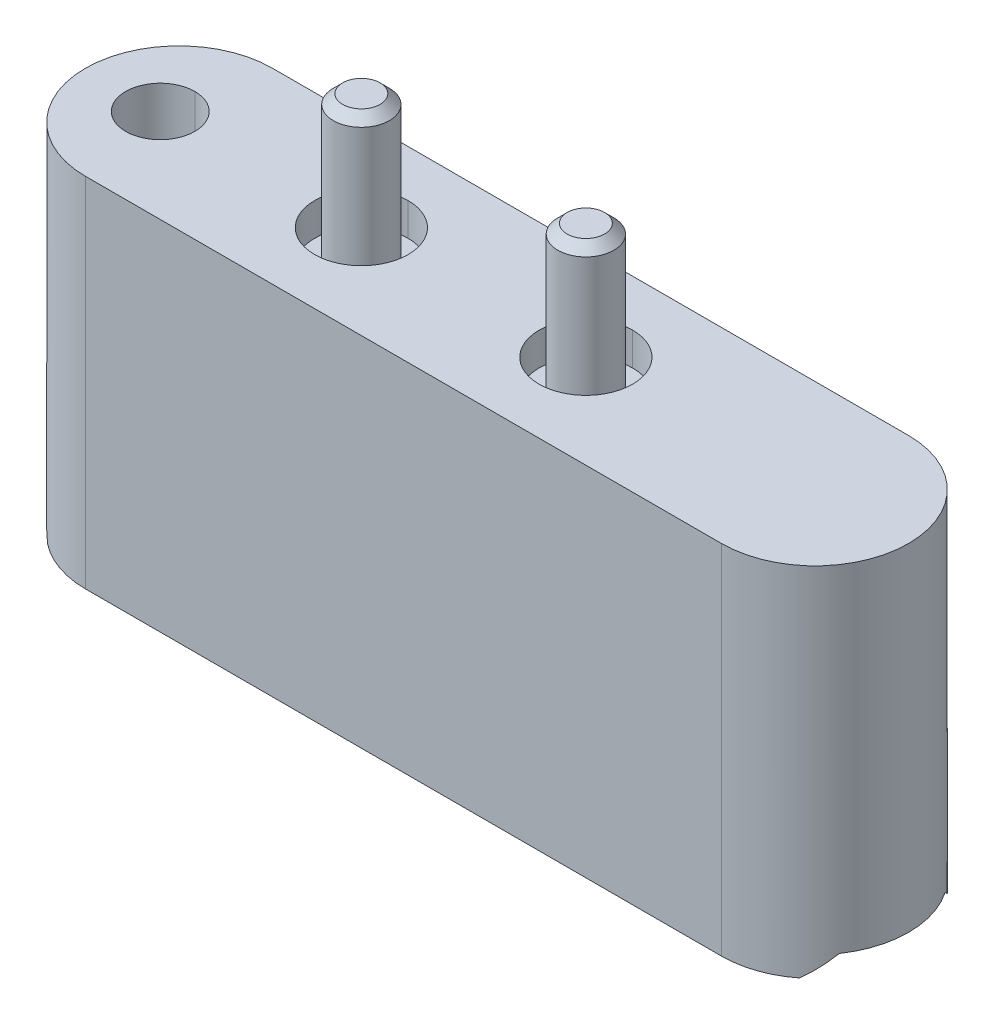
ISO-10303-21;
HEADER;
FILE_DESCRIPTION(('STEP AP214'),'2;1');
FILE_NAME('part.step','',(''),(''),'','','');
FILE_SCHEMA(('AUTOMOTIVE_DESIGN { 1 0 10303 214 1 1 1 1 }'));
ENDSEC;
DATA;
#1=APPLICATION_CONTEXT('core data for automotive mechanical design processes');
#2=APPLICATION_PROTOCOL_DEFINITION('international standard','automotive_design',2000,#1);
#3=PRODUCT_CONTEXT('',#1,'mechanical');
#4=PRODUCT('Part','Part','',(#3));
#5=PRODUCT_RELATED_PRODUCT_CATEGORY('part','',(#4));
#6=PRODUCT_DEFINITION_FORMATION('','',#4);
#7=PRODUCT_DEFINITION_CONTEXT('part definition',#1,'design');
#8=PRODUCT_DEFINITION('design','',#6,#7);
#9=PRODUCT_DEFINITION_SHAPE('','',#8);
#10=(LENGTH_UNIT() NAMED_UNIT(*) SI_UNIT(.MILLI.,.METRE.));
#11=(NAMED_UNIT(*) PLANE_ANGLE_UNIT() SI_UNIT($,.RADIAN.));
#12=(NAMED_UNIT(*) SI_UNIT($,.STERADIAN.) SOLID_ANGLE_UNIT());
#13=UNCERTAINTY_MEASURE_WITH_UNIT(LENGTH_MEASURE(1.E-05),#10,'distance_accuracy_value','');
#14=(GEOMETRIC_REPRESENTATION_CONTEXT(3) GLOBAL_UNCERTAINTY_ASSIGNED_CONTEXT((#13)) GLOBAL_UNIT_ASSIGNED_CONTEXT((#10,
#11,#12)) REPRESENTATION_CONTEXT('',''));
#15=CARTESIAN_POINT('',(0.,0.,0.));
#16=DIRECTION('',(0.,0.,1.));
#17=DIRECTION('',(1.,0.,0.));
#18=AXIS2_PLACEMENT_3D('',#15,#16,#17);
#19=CARTESIAN_POINT('',(-4.5,-14.,0.));
#20=DIRECTION('',(0.,1.,0.));
#21=DIRECTION('',(1.,0.,0.));
#22=AXIS2_PLACEMENT_3D('',#19,#20,#21);
#23=PLANE('',#22);
#24=CARTESIAN_POINT('',(24.,-14.,0.));
#25=DIRECTION('',(0.,1.,0.));
#26=DIRECTION('',(0.,0.,1.));
#27=AXIS2_PLACEMENT_3D('',#24,#25,#26);
#28=CIRCLE('',#27,3.7);
#29=CARTESIAN_POINT('',(21.6786666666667,-14.,-2.88121702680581));
#30=VERTEX_POINT('',#29);
#31=CARTESIAN_POINT('',(21.6786666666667,-14.,2.8812170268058));
#32=VERTEX_POINT('',#31);
#33=EDGE_CURVE('E33',#30,#32,#28,.T.);
#34=ORIENTED_EDGE('',*,*,#33,.F.);
#35=CARTESIAN_POINT('',(21.5,-14.,0.));
#36=DIRECTION('',(0.,1.,0.));
#37=DIRECTION('',(0.,0.,1.));
#38=AXIS2_PLACEMENT_3D('',#35,#36,#37);
#39=CIRCLE('',#38,2.88675134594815);
#40=EDGE_CURVE('E30',#30,#32,#39,.T.);
#41=ORIENTED_EDGE('',*,*,#40,.T.);
#42=EDGE_LOOP('',(#34,#41));
#43=FACE_BOUND('',#42,.T.);
#44=ADVANCED_FACE('F16',(#43),#23,.T.);
#45=CARTESIAN_POINT('',(0.,-14.,0.));
#46=DIRECTION('',(0.,1.,0.));
#47=DIRECTION('',(0.,0.,1.));
#48=AXIS2_PLACEMENT_3D('',#45,#46,#47);
#49=CIRCLE('',#48,3.7);
#50=CARTESIAN_POINT('',(-2.32133333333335,-14.,-2.88121702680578));
#51=VERTEX_POINT('',#50);
#52=CARTESIAN_POINT('',(-2.32133333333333,-14.,2.88121702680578));
#53=VERTEX_POINT('',#52);
#54=EDGE_CURVE('E807',#51,#53,#49,.T.);
#55=ORIENTED_EDGE('',*,*,#54,.F.);
#56=CARTESIAN_POINT('',(-2.5,-14.,0.));
#57=DIRECTION('',(0.,1.,0.));
#58=DIRECTION('',(0.,0.,1.));
#59=AXIS2_PLACEMENT_3D('',#56,#57,#58);
#60=CIRCLE('',#59,2.88675134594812);
#61=EDGE_CURVE('E510',#51,#53,#60,.T.);
#62=ORIENTED_EDGE('',*,*,#61,.T.);
#63=EDGE_LOOP('',(#55,#62));
#64=FACE_BOUND('',#63,.T.);
#65=ADVANCED_FACE('F1150',(#64),#23,.T.);
#66=CARTESIAN_POINT('',(48.,-17.,0.));
#67=DIRECTION('',(0.,1.,0.));
#68=DIRECTION('',(1.,0.,0.));
#69=AXIS2_PLACEMENT_3D('',#66,#67,#68);
#70=PLANE('',#69);
#71=DIRECTION('',(-1.,0.,0.));
#72=VECTOR('',#71,1.);
#73=CARTESIAN_POINT('',(52.5195180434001,-17.,0.5));
#74=LINE('',#73,#72);
#75=CARTESIAN_POINT('',(49.6248076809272,-17.,0.5));
#76=VERTEX_POINT('',#75);
#77=CARTESIAN_POINT('',(46.3751923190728,-17.,0.5));
#78=VERTEX_POINT('',#77);
#79=EDGE_CURVE('E1095',#76,#78,#74,.T.);
#80=ORIENTED_EDGE('',*,*,#79,.F.);
#81=CARTESIAN_POINT('',(48.,-17.,0.));
#82=DIRECTION('',(0.,1.,0.));
#83=DIRECTION('',(1.,0.,0.));
#84=AXIS2_PLACEMENT_3D('',#81,#82,#83);
#85=CIRCLE('',#84,1.7);
#86=EDGE_CURVE('E1308',#76,#78,#85,.F.);
#87=ORIENTED_EDGE('',*,*,#86,.T.);
#88=EDGE_LOOP('',(#80,#87));
#89=FACE_BOUND('',#88,.T.);
#90=ADVANCED_FACE('F1143',(#89),#70,.F.);
#91=DIRECTION('',(1.,0.,0.));
#92=VECTOR('',#91,1.);
#93=CARTESIAN_POINT('',(52.5195180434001,-17.,-0.5));
#94=LINE('',#93,#92);
#95=CARTESIAN_POINT('',(46.3751923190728,-17.,-0.5));
#96=VERTEX_POINT('',#95);
#97=CARTESIAN_POINT('',(49.6248076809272,-17.,-0.5));
#98=VERTEX_POINT('',#97);
#99=EDGE_CURVE('E1090',#96,#98,#94,.T.);
#100=ORIENTED_EDGE('',*,*,#99,.F.);
#101=CARTESIAN_POINT('',(48.,-17.,0.));
#102=DIRECTION('',(0.,1.,0.));
#103=DIRECTION('',(1.,0.,0.));
#104=AXIS2_PLACEMENT_3D('',#101,#102,#103);
#105=CIRCLE('',#104,1.7);
#106=EDGE_CURVE('E1106',#96,#98,#105,.F.);
#107=ORIENTED_EDGE('',*,*,#106,.T.);
#108=EDGE_LOOP('',(#100,#107));
#109=FACE_BOUND('',#108,.T.);
#110=ADVANCED_FACE('F1140',(#109),#70,.F.);
#111=CARTESIAN_POINT('',(48.,-22.5138090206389,0.));
#112=DIRECTION('',(0.,-1.,0.));
#113=DIRECTION('',(-1.,0.,0.));
#114=AXIS2_PLACEMENT_3D('',#111,#112,#113);
#115=CYLINDRICAL_SURFACE('',#114,2.7);
#116=CARTESIAN_POINT('',(48.,-16.,0.));
#117=DIRECTION('',(0.,-1.,0.));
#118=DIRECTION('',(-1.,0.,0.));
#119=AXIS2_PLACEMENT_3D('',#116,#117,#118);
#120=CIRCLE('',#119,2.7);
#121=CARTESIAN_POINT('',(50.6532998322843,-16.,-0.5));
#122=VERTEX_POINT('',#121);
#123=CARTESIAN_POINT('',(50.6532998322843,-16.,0.5));
#124=VERTEX_POINT('',#123);
#125=EDGE_CURVE('E1105',#122,#124,#120,.T.);
#126=ORIENTED_EDGE('',*,*,#125,.F.);
#127=CARTESIAN_POINT('',(48.,-16.,0.));
#128=DIRECTION('',(0.,1.,0.));
#129=DIRECTION('',(1.,0.,0.));
#130=AXIS2_PLACEMENT_3D('',#127,#128,#129);
#131=CIRCLE('',#130,2.7);
#132=CARTESIAN_POINT('',(45.3467001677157,-16.,-0.5));
#133=VERTEX_POINT('',#132);
#134=EDGE_CURVE('E1312',#122,#133,#131,.T.);
#135=ORIENTED_EDGE('',*,*,#134,.T.);
#136=CARTESIAN_POINT('',(45.3467001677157,-16.,0.5));
#137=VERTEX_POINT('',#136);
#138=EDGE_CURVE('E1098',#137,#133,#120,.T.);
#139=ORIENTED_EDGE('',*,*,#138,.F.);
#140=CARTESIAN_POINT('',(48.,-16.,0.));
#141=DIRECTION('',(0.,1.,0.));
#142=DIRECTION('',(1.,0.,0.));
#143=AXIS2_PLACEMENT_3D('',#140,#141,#142);
#144=CIRCLE('',#143,2.7);
#145=EDGE_CURVE('E1306',#137,#124,#144,.T.);
#146=ORIENTED_EDGE('',*,*,#145,.T.);
#147=EDGE_LOOP('',(#126,#135,#139,#146));
#148=FACE_BOUND('',#147,.T.);
#149=CARTESIAN_POINT('',(48.,-15.,0.));
#150=DIRECTION('',(0.,1.,0.));
#151=DIRECTION('',(0.,0.,1.));
#152=AXIS2_PLACEMENT_3D('',#149,#150,#151);
#153=CIRCLE('',#152,2.7);
#154=CARTESIAN_POINT('',(48.,-15.,2.7));
#155=VERTEX_POINT('',#154);
#156=EDGE_CURVE('E1051',#155,#155,#153,.T.);
#157=ORIENTED_EDGE('',*,*,#156,.F.);
#158=EDGE_LOOP('',(#157));
#159=FACE_BOUND('',#158,.T.);
#160=ADVANCED_FACE('F1137',(#148,#159),#115,.T.);
#161=CARTESIAN_POINT('',(52.5195180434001,-16.,0.5));
#162=DIRECTION('',(0.,0.,1.));
#163=DIRECTION('',(1.,0.,0.));
#164=AXIS2_PLACEMENT_3D('',#161,#162,#163);
#165=PLANE('',#164);
#166=ORIENTED_EDGE('',*,*,#79,.T.);
#167=CARTESIAN_POINT('',(46.3751923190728,-17.,0.5));
#168=CARTESIAN_POINT('',(46.3453491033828,-16.9999999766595,0.5));
#169=CARTESIAN_POINT('',(46.3155178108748,-16.9987786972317,0.5));
#170=CARTESIAN_POINT('',(46.2560535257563,-16.9938726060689,0.5));
#171=CARTESIAN_POINT('',(46.2264205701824,-16.990187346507,0.5));
#172=CARTESIAN_POINT('',(46.1381094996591,-16.9754067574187,0.5));
#173=CARTESIAN_POINT('',(46.0800066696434,-16.9605866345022,0.5));
#174=CARTESIAN_POINT('',(45.9671179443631,-16.921200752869,0.5));
#175=CARTESIAN_POINT('',(45.9123375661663,-16.8966192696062,0.5));
#176=CARTESIAN_POINT('',(45.8079226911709,-16.8382990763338,0.5));
#177=CARTESIAN_POINT('',(45.7582841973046,-16.8045675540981,0.5));
#178=CARTESIAN_POINT('',(45.6673408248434,-16.7301780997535,0.5));
#179=CARTESIAN_POINT('',(45.6258076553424,-16.6897990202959,0.5));
#180=CARTESIAN_POINT('',(45.5503053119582,-16.6024694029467,0.5));
#181=CARTESIAN_POINT('',(45.5163378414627,-16.555517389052,0.5));
#182=CARTESIAN_POINT('',(45.4577985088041,-16.457647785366,0.5));
#183=CARTESIAN_POINT('',(45.4330174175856,-16.4068550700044,0.5));
#184=CARTESIAN_POINT('',(45.3924856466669,-16.301810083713,0.5));
#185=CARTESIAN_POINT('',(45.3767266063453,-16.247561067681,0.5));
#186=CARTESIAN_POINT('',(45.3593915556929,-16.160725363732,0.5));
#187=CARTESIAN_POINT('',(45.3546339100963,-16.1287410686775,0.5));
#188=CARTESIAN_POINT('',(45.3482897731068,-16.0645095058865,0.5));
#189=CARTESIAN_POINT('',(45.3466983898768,-16.0322627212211,0.5));
#190=CARTESIAN_POINT('',(45.3467001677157,-16.,0.5));
#191=B_SPLINE_CURVE_WITH_KNOTS('',3,(#167,#168,#169,#170,#171,#172,#173,#174,#175,#176,#177,
#178,#179,#180,#181,#182,#183,#184,#185,#186,#187,#188,#189,#190),.UNSPECIFIED.,.F.,.F.,(4,2,2,
2,2,2,2,2,2,2,2,4),(0.,0.0894794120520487,0.178975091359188,0.35792938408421,0.537173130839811,
0.716276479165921,0.889205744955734,1.06217390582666,1.23091719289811,1.39950385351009,
1.4963712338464,1.59308883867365),.UNSPECIFIED.);
#192=EDGE_CURVE('E1302',#78,#137,#191,.T.);
#193=ORIENTED_EDGE('',*,*,#192,.T.);
#194=DIRECTION('',(-1.,0.,0.));
#195=VECTOR('',#194,1.);
#196=CARTESIAN_POINT('',(52.5195180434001,-16.,0.5));
#197=LINE('',#196,#195);
#198=EDGE_CURVE('E1094',#124,#137,#197,.T.);
#199=ORIENTED_EDGE('',*,*,#198,.F.);
#200=CARTESIAN_POINT('',(50.6532998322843,-16.,0.5));
#201=CARTESIAN_POINT('',(50.6532998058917,-16.0277394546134,0.5));
#202=CARTESIAN_POINT('',(50.6521245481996,-16.0554655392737,0.5));
#203=CARTESIAN_POINT('',(50.6474370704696,-16.1107174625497,0.5));
#204=CARTESIAN_POINT('',(50.6439250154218,-16.1382433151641,0.5));
#205=CARTESIAN_POINT('',(50.6299225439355,-16.2201556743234,0.5));
#206=CARTESIAN_POINT('',(50.6159656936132,-16.273990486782,0.5));
#207=CARTESIAN_POINT('',(50.5792211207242,-16.3785461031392,0.5));
#208=CARTESIAN_POINT('',(50.5564301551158,-16.4292657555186,0.5));
#209=CARTESIAN_POINT('',(50.50270161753,-16.5261894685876,0.5));
#210=CARTESIAN_POINT('',(50.4717645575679,-16.5723938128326,0.5));
#211=CARTESIAN_POINT('',(50.4024693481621,-16.6592678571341,0.5));
#212=CARTESIAN_POINT('',(50.364071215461,-16.6999056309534,0.5));
#213=CARTESIAN_POINT('',(50.2810903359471,-16.7742815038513,0.5));
#214=CARTESIAN_POINT('',(50.2365069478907,-16.8080188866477,0.5));
#215=CARTESIAN_POINT('',(50.141678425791,-16.8682445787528,0.5));
#216=CARTESIAN_POINT('',(50.0913534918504,-16.8946070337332,0.5));
#217=CARTESIAN_POINT('',(49.9870685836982,-16.9387594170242,0.5));
#218=CARTESIAN_POINT('',(49.9331084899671,-16.9565490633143,0.5));
#219=CARTESIAN_POINT('',(49.8366421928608,-16.9799560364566,0.5));
#220=CARTESIAN_POINT('',(49.7945883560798,-16.9874922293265,0.5));
#221=CARTESIAN_POINT('',(49.7099595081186,-16.9975153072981,0.5));
#222=CARTESIAN_POINT('',(49.6673855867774,-17.0000113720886,0.5));
#223=CARTESIAN_POINT('',(49.6248076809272,-17.,0.5));
#224=B_SPLINE_CURVE_WITH_KNOTS('',3,(#200,#201,#202,#203,#204,#205,#206,#207,#208,#209,#210,
#211,#212,#213,#214,#215,#216,#217,#218,#219,#220,#221,#222,#223),.UNSPECIFIED.,.F.,.F.,(4,2,2,
2,2,2,2,2,2,2,2,4),(0.,0.0831669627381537,0.166328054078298,0.332314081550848,0.498361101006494,
0.664397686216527,0.831349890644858,0.998319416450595,1.16798514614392,1.33765645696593,
1.46553725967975,1.59318493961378),.UNSPECIFIED.);
#225=EDGE_CURVE('E1300',#124,#76,#224,.T.);
#226=ORIENTED_EDGE('',*,*,#225,.T.);
#227=EDGE_LOOP('',(#166,#193,#199,#226));
#228=FACE_BOUND('',#227,.T.);
#229=ADVANCED_FACE('F1133',(#228),#165,.F.);
#230=CARTESIAN_POINT('',(52.5195180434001,-16.,-0.5));
#231=DIRECTION('',(0.,0.,-1.));
#232=DIRECTION('',(-1.,0.,0.));
#233=AXIS2_PLACEMENT_3D('',#230,#231,#232);
#234=PLANE('',#233);
#235=ORIENTED_EDGE('',*,*,#99,.T.);
#236=CARTESIAN_POINT('',(49.6248076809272,-17.,-0.5));
#237=CARTESIAN_POINT('',(49.6546508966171,-16.9999999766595,-0.5));
#238=CARTESIAN_POINT('',(49.6844821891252,-16.9987786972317,-0.5));
#239=CARTESIAN_POINT('',(49.7439464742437,-16.9938726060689,-0.5));
#240=CARTESIAN_POINT('',(49.7735794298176,-16.990187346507,-0.5));
#241=CARTESIAN_POINT('',(49.8618905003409,-16.9754067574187,-0.5));
#242=CARTESIAN_POINT('',(49.9199933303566,-16.9605866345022,-0.5));
#243=CARTESIAN_POINT('',(50.0328820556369,-16.921200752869,-0.5));
#244=CARTESIAN_POINT('',(50.0876624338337,-16.8966192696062,-0.5));
#245=CARTESIAN_POINT('',(50.1920773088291,-16.8382990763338,-0.5));
#246=CARTESIAN_POINT('',(50.2417158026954,-16.8045675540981,-0.5));
#247=CARTESIAN_POINT('',(50.3326591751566,-16.7301780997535,-0.5));
#248=CARTESIAN_POINT('',(50.3741923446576,-16.6897990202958,-0.5));
#249=CARTESIAN_POINT('',(50.4496946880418,-16.6024694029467,-0.5));
#250=CARTESIAN_POINT('',(50.4836621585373,-16.555517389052,-0.5));
#251=CARTESIAN_POINT('',(50.5422014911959,-16.457647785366,-0.5));
#252=CARTESIAN_POINT('',(50.5669825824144,-16.4068550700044,-0.5));
#253=CARTESIAN_POINT('',(50.6075143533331,-16.3018100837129,-0.5));
#254=CARTESIAN_POINT('',(50.6232733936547,-16.247561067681,-0.5));
#255=CARTESIAN_POINT('',(50.6406084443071,-16.160725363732,-0.5));
#256=CARTESIAN_POINT('',(50.6453660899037,-16.1287410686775,-0.5));
#257=CARTESIAN_POINT('',(50.6517102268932,-16.0645095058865,-0.5));
#258=CARTESIAN_POINT('',(50.6533016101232,-16.0322627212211,-0.5));
#259=CARTESIAN_POINT('',(50.6532998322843,-16.,-0.5));
#260=B_SPLINE_CURVE_WITH_KNOTS('',3,(#236,#237,#238,#239,#240,#241,#242,#243,#244,#245,#246,
#247,#248,#249,#250,#251,#252,#253,#254,#255,#256,#257,#258,#259),.UNSPECIFIED.,.F.,.F.,(4,2,2,
2,2,2,2,2,2,2,2,4),(0.,0.0894794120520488,0.178975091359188,0.357929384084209,0.537173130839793,
0.716276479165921,0.889205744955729,1.06217390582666,1.23091719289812,1.39950385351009,
1.4963712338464,1.59308883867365),.UNSPECIFIED.);
#261=EDGE_CURVE('E1117',#98,#122,#260,.T.);
#262=ORIENTED_EDGE('',*,*,#261,.T.);
#263=DIRECTION('',(1.,0.,0.));
#264=VECTOR('',#263,1.);
#265=CARTESIAN_POINT('',(52.5195180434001,-16.,-0.5));
#266=LINE('',#265,#264);
#267=EDGE_CURVE('E1091',#133,#122,#266,.T.);
#268=ORIENTED_EDGE('',*,*,#267,.F.);
#269=CARTESIAN_POINT('',(45.3467001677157,-16.,-0.5));
#270=CARTESIAN_POINT('',(45.3467001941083,-16.0277394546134,-0.5));
#271=CARTESIAN_POINT('',(45.3478754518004,-16.0554655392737,-0.5));
#272=CARTESIAN_POINT('',(45.3525629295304,-16.1107174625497,-0.5));
#273=CARTESIAN_POINT('',(45.3560749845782,-16.1382433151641,-0.5));
#274=CARTESIAN_POINT('',(45.3700774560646,-16.2201556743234,-0.5));
#275=CARTESIAN_POINT('',(45.3840343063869,-16.273990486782,-0.5));
#276=CARTESIAN_POINT('',(45.4207788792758,-16.3785461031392,-0.5));
#277=CARTESIAN_POINT('',(45.4435698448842,-16.4292657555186,-0.5));
#278=CARTESIAN_POINT('',(45.49729838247,-16.5261894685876,-0.5));
#279=CARTESIAN_POINT('',(45.5282354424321,-16.5723938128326,-0.5));
#280=CARTESIAN_POINT('',(45.5975306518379,-16.6592678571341,-0.5));
#281=CARTESIAN_POINT('',(45.635928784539,-16.6999056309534,-0.5));
#282=CARTESIAN_POINT('',(45.7189096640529,-16.7742815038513,-0.5));
#283=CARTESIAN_POINT('',(45.7634930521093,-16.8080188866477,-0.5));
#284=CARTESIAN_POINT('',(45.858321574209,-16.8682445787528,-0.5));
#285=CARTESIAN_POINT('',(45.9086465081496,-16.8946070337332,-0.5));
#286=CARTESIAN_POINT('',(46.0129314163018,-16.9387594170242,-0.5));
#287=CARTESIAN_POINT('',(46.0668915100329,-16.9565490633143,-0.5));
#288=CARTESIAN_POINT('',(46.1633578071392,-16.9799560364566,-0.5));
#289=CARTESIAN_POINT('',(46.2054116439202,-16.9874922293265,-0.5));
#290=CARTESIAN_POINT('',(46.2900404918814,-16.9975153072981,-0.5));
#291=CARTESIAN_POINT('',(46.3326144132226,-17.0000113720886,-0.5));
#292=CARTESIAN_POINT('',(46.3751923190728,-17.,-0.5));
#293=B_SPLINE_CURVE_WITH_KNOTS('',3,(#269,#270,#271,#272,#273,#274,#275,#276,#277,#278,#279,
#280,#281,#282,#283,#284,#285,#286,#287,#288,#289,#290,#291,#292),.UNSPECIFIED.,.F.,.F.,(4,2,2,
2,2,2,2,2,2,2,2,4),(0.,0.0831669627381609,0.166328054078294,0.33231408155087,0.498361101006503,
0.664397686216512,0.831349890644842,0.998319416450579,1.1679851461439,1.33765645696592,
1.46553725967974,1.59318493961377),.UNSPECIFIED.);
#294=EDGE_CURVE('E1109',#133,#96,#293,.T.);
#295=ORIENTED_EDGE('',*,*,#294,.T.);
#296=EDGE_LOOP('',(#235,#262,#268,#295));
#297=FACE_BOUND('',#296,.T.);
#298=ADVANCED_FACE('F1127',(#297),#234,.F.);
#299=CARTESIAN_POINT('',(48.,-16.,0.));
#300=DIRECTION('',(0.,-1.,0.));
#301=DIRECTION('',(-1.,0.,0.));
#302=AXIS2_PLACEMENT_3D('',#299,#300,#301);
#303=PLANE('',#302);
#304=ORIENTED_EDGE('',*,*,#125,.T.);
#305=ORIENTED_EDGE('',*,*,#198,.T.);
#306=ORIENTED_EDGE('',*,*,#138,.T.);
#307=ORIENTED_EDGE('',*,*,#267,.T.);
#308=EDGE_LOOP('',(#304,#305,#306,#307));
#309=FACE_BOUND('',#308,.T.);
#310=ADVANCED_FACE('F1132',(#309),#303,.T.);
#311=CARTESIAN_POINT('',(48.,-16.,0.));
#312=DIRECTION('',(0.,1.,0.));
#313=DIRECTION('',(1.,0.,0.));
#314=AXIS2_PLACEMENT_3D('',#311,#312,#313);
#315=TOROIDAL_SURFACE('',#314,1.7,1.);
#316=ORIENTED_EDGE('',*,*,#294,.F.);
#317=ORIENTED_EDGE('',*,*,#134,.F.);
#318=ORIENTED_EDGE('',*,*,#261,.F.);
#319=ORIENTED_EDGE('',*,*,#106,.F.);
#320=EDGE_LOOP('',(#316,#317,#318,#319));
#321=FACE_BOUND('',#320,.T.);
#322=ADVANCED_FACE('F1123',(#321),#315,.T.);
#323=CARTESIAN_POINT('',(48.,-16.,0.));
#324=DIRECTION('',(0.,1.,0.));
#325=DIRECTION('',(1.,0.,0.));
#326=AXIS2_PLACEMENT_3D('',#323,#324,#325);
#327=TOROIDAL_SURFACE('',#326,1.7,1.);
#328=ORIENTED_EDGE('',*,*,#225,.F.);
#329=ORIENTED_EDGE('',*,*,#145,.F.);
#330=ORIENTED_EDGE('',*,*,#192,.F.);
#331=ORIENTED_EDGE('',*,*,#86,.F.);
#332=EDGE_LOOP('',(#328,#329,#330,#331));
#333=FACE_BOUND('',#332,.T.);
#334=ADVANCED_FACE('F1290',(#333),#327,.T.);
#335=CARTESIAN_POINT('',(48.,-15.,0.));
#336=DIRECTION('',(0.,1.,0.));
#337=DIRECTION('',(1.,0.,0.));
#338=AXIS2_PLACEMENT_3D('',#335,#336,#337);
#339=PLANE('',#338);
#340=ORIENTED_EDGE('',*,*,#156,.T.);
#341=EDGE_LOOP('',(#340));
#342=FACE_BOUND('',#341,.T.);
#343=CARTESIAN_POINT('',(48.,-15.,0.));
#344=DIRECTION('',(0.,1.,0.));
#345=DIRECTION('',(0.,0.,1.));
#346=AXIS2_PLACEMENT_3D('',#343,#344,#345);
#347=CIRCLE('',#346,3.);
#348=CARTESIAN_POINT('',(48.,-15.,-3.));
#349=VERTEX_POINT('',#348);
#350=CARTESIAN_POINT('',(48.,-15.,3.));
#351=VERTEX_POINT('',#350);
#352=EDGE_CURVE('E657',#349,#351,#347,.T.);
#353=ORIENTED_EDGE('',*,*,#352,.F.);
#354=CARTESIAN_POINT('',(48.,-15.,0.));
#355=DIRECTION('',(0.,1.,0.));
#356=DIRECTION('',(0.,0.,1.));
#357=AXIS2_PLACEMENT_3D('',#354,#355,#356);
#358=CIRCLE('',#357,3.);
#359=EDGE_CURVE('E789',#351,#349,#358,.T.);
#360=ORIENTED_EDGE('',*,*,#359,.F.);
#361=EDGE_LOOP('',(#353,#360));
#362=FACE_BOUND('',#361,.T.);
#363=ADVANCED_FACE('F1231',(#342,#362),#339,.F.);
#364=CARTESIAN_POINT('',(48.,-23.5,0.));
#365=DIRECTION('',(0.,1.,0.));
#366=DIRECTION('',(1.,0.,0.));
#367=AXIS2_PLACEMENT_3D('',#364,#365,#366);
#368=PLANE('',#367);
#369=CARTESIAN_POINT('',(48.,-23.5,0.));
#370=DIRECTION('',(0.,1.,0.));
#371=DIRECTION('',(0.,0.,1.));
#372=AXIS2_PLACEMENT_3D('',#369,#370,#371);
#373=CIRCLE('',#372,3.);
#374=CARTESIAN_POINT('',(48.,-23.5,-3.));
#375=VERTEX_POINT('',#374);
#376=CARTESIAN_POINT('',(48.,-23.5,3.));
#377=VERTEX_POINT('',#376);
#378=EDGE_CURVE('E866',#375,#377,#373,.T.);
#379=ORIENTED_EDGE('',*,*,#378,.T.);
#380=CARTESIAN_POINT('',(48.,-23.5,0.));
#381=DIRECTION('',(0.,1.,0.));
#382=DIRECTION('',(0.,0.,1.));
#383=AXIS2_PLACEMENT_3D('',#380,#381,#382);
#384=CIRCLE('',#383,3.);
#385=EDGE_CURVE('E782',#377,#375,#384,.T.);
#386=ORIENTED_EDGE('',*,*,#385,.T.);
#387=EDGE_LOOP('',(#379,#386));
#388=FACE_BOUND('',#387,.T.);
#389=CARTESIAN_POINT('',(48.,-23.5,0.));
#390=DIRECTION('',(0.,-1.,0.));
#391=DIRECTION('',(0.,0.,1.));
#392=AXIS2_PLACEMENT_3D('',#389,#390,#391);
#393=CIRCLE('',#392,3.7);
#394=CARTESIAN_POINT('',(48.,-23.5,-3.7));
#395=VERTEX_POINT('',#394);
#396=CARTESIAN_POINT('',(48.,-23.5,3.7));
#397=VERTEX_POINT('',#396);
#398=EDGE_CURVE('E788',#395,#397,#393,.T.);
#399=ORIENTED_EDGE('',*,*,#398,.T.);
#400=CARTESIAN_POINT('',(48.,-23.5,0.));
#401=DIRECTION('',(0.,-1.,0.));
#402=DIRECTION('',(0.,0.,1.));
#403=AXIS2_PLACEMENT_3D('',#400,#401,#402);
#404=CIRCLE('',#403,3.7);
#405=EDGE_CURVE('E752',#397,#395,#404,.T.);
#406=ORIENTED_EDGE('',*,*,#405,.T.);
#407=EDGE_LOOP('',(#399,#406));
#408=FACE_BOUND('',#407,.T.);
#409=ADVANCED_FACE('F1200',(#388,#408),#368,.F.);
#410=CARTESIAN_POINT('',(48.,-36.,0.));
#411=DIRECTION('',(0.,-1.,0.));
#412=DIRECTION('',(0.,0.,-1.));
#413=AXIS2_PLACEMENT_3D('',#410,#411,#412);
#414=CONICAL_SURFACE('',#413,5.5,0.785398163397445);
#415=DIRECTION('',(0.,-0.70710678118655,0.707106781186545));
#416=VECTOR('',#415,1.);
#417=CARTESIAN_POINT('',(48.,-36.,5.5));
#418=LINE('',#417,#416);
#419=CARTESIAN_POINT('',(48.,-35.5,5.));
#420=VERTEX_POINT('',#419);
#421=CARTESIAN_POINT('',(48.,-36.,5.5));
#422=VERTEX_POINT('',#421);
#423=EDGE_CURVE('E669',#420,#422,#418,.T.);
#424=ORIENTED_EDGE('',*,*,#423,.F.);
#425=CARTESIAN_POINT('',(48.,-35.5,0.));
#426=DIRECTION('',(0.,-1.,0.));
#427=DIRECTION('',(0.,0.,1.));
#428=AXIS2_PLACEMENT_3D('',#425,#426,#427);
#429=CIRCLE('',#428,5.);
#430=CARTESIAN_POINT('',(48.,-35.5,-5.));
#431=VERTEX_POINT('',#430);
#432=EDGE_CURVE('E678',#431,#420,#429,.T.);
#433=ORIENTED_EDGE('',*,*,#432,.F.);
#434=DIRECTION('',(0.,-0.70710678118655,-0.707106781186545));
#435=VECTOR('',#434,1.);
#436=CARTESIAN_POINT('',(48.,-36.,-5.5));
#437=LINE('',#436,#435);
#438=CARTESIAN_POINT('',(48.,-36.,-5.5));
#439=VERTEX_POINT('',#438);
#440=EDGE_CURVE('E911',#431,#439,#437,.T.);
#441=ORIENTED_EDGE('',*,*,#440,.T.);
#442=CARTESIAN_POINT('',(48.,-36.,0.));
#443=DIRECTION('',(0.,1.,0.));
#444=DIRECTION('',(0.,0.,1.));
#445=AXIS2_PLACEMENT_3D('',#442,#443,#444);
#446=CIRCLE('',#445,5.5);
#447=EDGE_CURVE('E702',#422,#439,#446,.T.);
#448=ORIENTED_EDGE('',*,*,#447,.F.);
#449=EDGE_LOOP('',(#424,#433,#441,#448));
#450=FACE_BOUND('',#449,.T.);
#451=ADVANCED_FACE('F1190',(#450),#414,.F.);
#452=CARTESIAN_POINT('',(24.,-36.,0.));
#453=DIRECTION('',(0.,-1.,0.));
#454=DIRECTION('',(0.,0.,-1.));
#455=AXIS2_PLACEMENT_3D('',#452,#453,#454);
#456=CONICAL_SURFACE('',#455,5.5,0.785398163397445);
#457=DIRECTION('',(0.,-0.70710678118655,0.707106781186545));
#458=VECTOR('',#457,1.);
#459=CARTESIAN_POINT('',(24.,-36.,5.5));
#460=LINE('',#459,#458);
#461=CARTESIAN_POINT('',(24.,-35.5,5.));
#462=VERTEX_POINT('',#461);
#463=CARTESIAN_POINT('',(24.,-36.,5.5));
#464=VERTEX_POINT('',#463);
#465=EDGE_CURVE('E694',#462,#464,#460,.T.);
#466=ORIENTED_EDGE('',*,*,#465,.F.);
#467=CARTESIAN_POINT('',(24.,-35.5,0.));
#468=DIRECTION('',(0.,-1.,0.));
#469=DIRECTION('',(0.,0.,1.));
#470=AXIS2_PLACEMENT_3D('',#467,#468,#469);
#471=CIRCLE('',#470,5.);
#472=CARTESIAN_POINT('',(24.,-35.5,-5.));
#473=VERTEX_POINT('',#472);
#474=EDGE_CURVE('E798',#473,#462,#471,.T.);
#475=ORIENTED_EDGE('',*,*,#474,.F.);
#476=DIRECTION('',(0.,-0.70710678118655,-0.707106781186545));
#477=VECTOR('',#476,1.);
#478=CARTESIAN_POINT('',(24.,-36.,-5.5));
#479=LINE('',#478,#477);
#480=CARTESIAN_POINT('',(24.,-36.,-5.5));
#481=VERTEX_POINT('',#480);
#482=EDGE_CURVE('E685',#473,#481,#479,.T.);
#483=ORIENTED_EDGE('',*,*,#482,.T.);
#484=CARTESIAN_POINT('',(24.,-36.,0.));
#485=DIRECTION('',(0.,1.,0.));
#486=DIRECTION('',(0.,0.,1.));
#487=AXIS2_PLACEMENT_3D('',#484,#485,#486);
#488=CIRCLE('',#487,5.5);
#489=EDGE_CURVE('E747',#464,#481,#488,.T.);
#490=ORIENTED_EDGE('',*,*,#489,.F.);
#491=EDGE_LOOP('',(#466,#475,#483,#490));
#492=FACE_BOUND('',#491,.T.);
#493=ADVANCED_FACE('F1168',(#492),#456,.F.);
#494=CARTESIAN_POINT('',(0.,-36.,0.));
#495=DIRECTION('',(0.,-1.,0.));
#496=DIRECTION('',(0.,0.,-1.));
#497=AXIS2_PLACEMENT_3D('',#494,#495,#496);
#498=CONICAL_SURFACE('',#497,5.5,0.785398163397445);
#499=DIRECTION('',(0.,-0.70710678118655,0.707106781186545));
#500=VECTOR('',#499,1.);
#501=CARTESIAN_POINT('',(0.,-36.,5.5));
#502=LINE('',#501,#500);
#503=CARTESIAN_POINT('',(0.,-35.5,5.));
#504=VERTEX_POINT('',#503);
#505=CARTESIAN_POINT('',(0.,-36.,5.5));
#506=VERTEX_POINT('',#505);
#507=EDGE_CURVE('E727',#504,#506,#502,.T.);
#508=ORIENTED_EDGE('',*,*,#507,.F.);
#509=CARTESIAN_POINT('',(0.,-35.5,0.));
#510=DIRECTION('',(0.,-1.,0.));
#511=DIRECTION('',(0.,0.,1.));
#512=AXIS2_PLACEMENT_3D('',#509,#510,#511);
#513=CIRCLE('',#512,5.);
#514=CARTESIAN_POINT('',(0.,-35.5,-5.));
#515=VERTEX_POINT('',#514);
#516=EDGE_CURVE('E820',#515,#504,#513,.T.);
#517=ORIENTED_EDGE('',*,*,#516,.F.);
#518=DIRECTION('',(0.,-0.70710678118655,-0.707106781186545));
#519=VECTOR('',#518,1.);
#520=CARTESIAN_POINT('',(0.,-36.,-5.5));
#521=LINE('',#520,#519);
#522=CARTESIAN_POINT('',(0.,-36.,-5.5));
#523=VERTEX_POINT('',#522);
#524=EDGE_CURVE('E726',#515,#523,#521,.T.);
#525=ORIENTED_EDGE('',*,*,#524,.T.);
#526=CARTESIAN_POINT('',(0.,-36.,0.));
#527=DIRECTION('',(0.,1.,0.));
#528=DIRECTION('',(0.,0.,1.));
#529=AXIS2_PLACEMENT_3D('',#526,#527,#528);
#530=CIRCLE('',#529,5.5);
#531=EDGE_CURVE('E857',#506,#523,#530,.T.);
#532=ORIENTED_EDGE('',*,*,#531,.F.);
#533=EDGE_LOOP('',(#508,#517,#525,#532));
#534=FACE_BOUND('',#533,.T.);
#535=ADVANCED_FACE('F1164',(#534),#498,.F.);
#536=CARTESIAN_POINT('',(0.,0.,0.));
#537=DIRECTION('',(0.,-1.,0.));
#538=DIRECTION('',(0.,0.,-1.));
#539=AXIS2_PLACEMENT_3D('',#536,#537,#538);
#540=CYLINDRICAL_SURFACE('',#539,3.7);
#541=DIRECTION('',(0.,-1.,0.));
#542=VECTOR('',#541,1.);
#543=CARTESIAN_POINT('',(0.,0.,3.7));
#544=LINE('',#543,#542);
#545=CARTESIAN_POINT('',(0.,-14.,3.7));
#546=VERTEX_POINT('',#545);
#547=CARTESIAN_POINT('',(0.,-25.5,3.7));
#548=VERTEX_POINT('',#547);
#549=EDGE_CURVE('E835',#546,#548,#544,.T.);
#550=ORIENTED_EDGE('',*,*,#549,.F.);
#551=CARTESIAN_POINT('',(0.,-14.,0.));
#552=DIRECTION('',(0.,1.,0.));
#553=DIRECTION('',(0.,0.,1.));
#554=AXIS2_PLACEMENT_3D('',#551,#552,#553);
#555=CIRCLE('',#554,3.7);
#556=CARTESIAN_POINT('',(0.,-14.,-3.7));
#557=VERTEX_POINT('',#556);
#558=EDGE_CURVE('E854',#546,#557,#555,.T.);
#559=ORIENTED_EDGE('',*,*,#558,.T.);
#560=DIRECTION('',(0.,-1.,0.));
#561=VECTOR('',#560,1.);
#562=CARTESIAN_POINT('',(0.,0.,-3.7));
#563=LINE('',#562,#561);
#564=CARTESIAN_POINT('',(0.,-25.5,-3.7));
#565=VERTEX_POINT('',#564);
#566=EDGE_CURVE('E799',#557,#565,#563,.T.);
#567=ORIENTED_EDGE('',*,*,#566,.T.);
#568=CARTESIAN_POINT('',(0.,-25.5,0.));
#569=DIRECTION('',(0.,-1.,0.));
#570=DIRECTION('',(0.,0.,-1.));
#571=AXIS2_PLACEMENT_3D('',#568,#569,#570);
#572=CIRCLE('',#571,3.7);
#573=EDGE_CURVE('E1048',#565,#548,#572,.T.);
#574=ORIENTED_EDGE('',*,*,#573,.T.);
#575=EDGE_LOOP('',(#550,#559,#567,#574));
#576=FACE_BOUND('',#575,.T.);
#577=ADVANCED_FACE('F1167',(#576),#540,.F.);
#578=CARTESIAN_POINT('',(0.,-25.5,0.));
#579=DIRECTION('',(0.,-1.,0.));
#580=DIRECTION('',(0.,0.,-1.));
#581=AXIS2_PLACEMENT_3D('',#578,#579,#580);
#582=PLANE('',#581);
#583=CARTESIAN_POINT('',(0.,-25.5,0.));
#584=DIRECTION('',(0.,1.,0.));
#585=DIRECTION('',(0.,0.,-1.));
#586=AXIS2_PLACEMENT_3D('',#583,#584,#585);
#587=CIRCLE('',#586,3.);
#588=CARTESIAN_POINT('',(0.,-25.5,-3.));
#589=VERTEX_POINT('',#588);
#590=CARTESIAN_POINT('',(0.,-25.5,3.));
#591=VERTEX_POINT('',#590);
#592=EDGE_CURVE('E683',#589,#591,#587,.T.);
#593=ORIENTED_EDGE('',*,*,#592,.F.);
#594=CARTESIAN_POINT('',(0.,-25.5,0.));
#595=DIRECTION('',(0.,1.,0.));
#596=DIRECTION('',(0.,0.,-1.));
#597=AXIS2_PLACEMENT_3D('',#594,#595,#596);
#598=CIRCLE('',#597,3.);
#599=EDGE_CURVE('E769',#591,#589,#598,.T.);
#600=ORIENTED_EDGE('',*,*,#599,.F.);
#601=EDGE_LOOP('',(#593,#600));
#602=FACE_BOUND('',#601,.T.);
#603=ORIENTED_EDGE('',*,*,#573,.F.);
#604=CARTESIAN_POINT('',(0.,-25.5,0.));
#605=DIRECTION('',(0.,-1.,0.));
#606=DIRECTION('',(0.,0.,-1.));
#607=AXIS2_PLACEMENT_3D('',#604,#605,#606);
#608=CIRCLE('',#607,3.7);
#609=EDGE_CURVE('E803',#548,#565,#608,.T.);
#610=ORIENTED_EDGE('',*,*,#609,.F.);
#611=EDGE_LOOP('',(#603,#610));
#612=FACE_BOUND('',#611,.T.);
#613=ADVANCED_FACE('F1214',(#602,#612),#582,.F.);
#614=CARTESIAN_POINT('',(24.,0.,0.));
#615=DIRECTION('',(0.,-1.,0.));
#616=DIRECTION('',(0.,0.,-1.));
#617=AXIS2_PLACEMENT_3D('',#614,#615,#616);
#618=CYLINDRICAL_SURFACE('',#617,3.7);
#619=DIRECTION('',(0.,-1.,0.));
#620=VECTOR('',#619,1.);
#621=CARTESIAN_POINT('',(24.,0.,3.7));
#622=LINE('',#621,#620);
#623=CARTESIAN_POINT('',(24.,-14.,3.7));
#624=VERTEX_POINT('',#623);
#625=CARTESIAN_POINT('',(24.,-25.5,3.7));
#626=VERTEX_POINT('',#625);
#627=EDGE_CURVE('E893',#624,#626,#622,.T.);
#628=ORIENTED_EDGE('',*,*,#627,.F.);
#629=CARTESIAN_POINT('',(24.,-14.,0.));
#630=DIRECTION('',(0.,1.,0.));
#631=DIRECTION('',(0.,0.,1.));
#632=AXIS2_PLACEMENT_3D('',#629,#630,#631);
#633=CIRCLE('',#632,3.7);
#634=CARTESIAN_POINT('',(24.,-14.,-3.7));
#635=VERTEX_POINT('',#634);
#636=EDGE_CURVE('E851',#624,#635,#633,.T.);
#637=ORIENTED_EDGE('',*,*,#636,.T.);
#638=DIRECTION('',(0.,-1.,0.));
#639=VECTOR('',#638,1.);
#640=CARTESIAN_POINT('',(24.,0.,-3.7));
#641=LINE('',#640,#639);
#642=CARTESIAN_POINT('',(24.,-25.5,-3.7));
#643=VERTEX_POINT('',#642);
#644=EDGE_CURVE('E825',#635,#643,#641,.T.);
#645=ORIENTED_EDGE('',*,*,#644,.T.);
#646=CARTESIAN_POINT('',(24.,-25.5,0.));
#647=DIRECTION('',(0.,-1.,0.));
#648=DIRECTION('',(0.,0.,-1.));
#649=AXIS2_PLACEMENT_3D('',#646,#647,#648);
#650=CIRCLE('',#649,3.7);
#651=EDGE_CURVE('E973',#643,#626,#650,.T.);
#652=ORIENTED_EDGE('',*,*,#651,.T.);
#653=EDGE_LOOP('',(#628,#637,#645,#652));
#654=FACE_BOUND('',#653,.T.);
#655=ADVANCED_FACE('F1196',(#654),#618,.F.);
#656=CARTESIAN_POINT('',(24.,-25.5,0.));
#657=DIRECTION('',(0.,-1.,0.));
#658=DIRECTION('',(0.,0.,-1.));
#659=AXIS2_PLACEMENT_3D('',#656,#657,#658);
#660=PLANE('',#659);
#661=CARTESIAN_POINT('',(24.,-25.5,0.));
#662=DIRECTION('',(0.,1.,0.));
#663=DIRECTION('',(0.,0.,-1.));
#664=AXIS2_PLACEMENT_3D('',#661,#662,#663);
#665=CIRCLE('',#664,3.);
#666=CARTESIAN_POINT('',(24.,-25.5,-3.));
#667=VERTEX_POINT('',#666);
#668=CARTESIAN_POINT('',(24.,-25.5,3.));
#669=VERTEX_POINT('',#668);
#670=EDGE_CURVE('E970',#667,#669,#665,.T.);
#671=ORIENTED_EDGE('',*,*,#670,.F.);
#672=CARTESIAN_POINT('',(24.,-25.5,0.));
#673=DIRECTION('',(0.,1.,0.));
#674=DIRECTION('',(0.,0.,-1.));
#675=AXIS2_PLACEMENT_3D('',#672,#673,#674);
#676=CIRCLE('',#675,3.);
#677=EDGE_CURVE('E762',#669,#667,#676,.T.);
#678=ORIENTED_EDGE('',*,*,#677,.F.);
#679=EDGE_LOOP('',(#671,#678));
#680=FACE_BOUND('',#679,.T.);
#681=ORIENTED_EDGE('',*,*,#651,.F.);
#682=CARTESIAN_POINT('',(24.,-25.5,0.));
#683=DIRECTION('',(0.,-1.,0.));
#684=DIRECTION('',(0.,0.,-1.));
#685=AXIS2_PLACEMENT_3D('',#682,#683,#684);
#686=CIRCLE('',#685,3.7);
#687=EDGE_CURVE('E938',#626,#643,#686,.T.);
#688=ORIENTED_EDGE('',*,*,#687,.F.);
#689=EDGE_LOOP('',(#681,#688));
#690=FACE_BOUND('',#689,.T.);
#691=ADVANCED_FACE('F1192',(#680,#690),#660,.F.);
#692=CARTESIAN_POINT('',(48.,-25.5,0.));
#693=DIRECTION('',(0.,-1.,0.));
#694=DIRECTION('',(0.,0.,-1.));
#695=AXIS2_PLACEMENT_3D('',#692,#693,#694);
#696=PLANE('',#695);
#697=CARTESIAN_POINT('',(48.,-25.5,0.));
#698=DIRECTION('',(0.,1.,0.));
#699=DIRECTION('',(0.,0.,-1.));
#700=AXIS2_PLACEMENT_3D('',#697,#698,#699);
#701=CIRCLE('',#700,3.);
#702=CARTESIAN_POINT('',(48.,-25.5,-3.));
#703=VERTEX_POINT('',#702);
#704=CARTESIAN_POINT('',(48.,-25.5,3.));
#705=VERTEX_POINT('',#704);
#706=EDGE_CURVE('E821',#703,#705,#701,.T.);
#707=ORIENTED_EDGE('',*,*,#706,.F.);
#708=CARTESIAN_POINT('',(48.,-25.5,0.));
#709=DIRECTION('',(0.,1.,0.));
#710=DIRECTION('',(0.,0.,-1.));
#711=AXIS2_PLACEMENT_3D('',#708,#709,#710);
#712=CIRCLE('',#711,3.);
#713=EDGE_CURVE('E768',#705,#703,#712,.T.);
#714=ORIENTED_EDGE('',*,*,#713,.F.);
#715=EDGE_LOOP('',(#707,#714));
#716=FACE_BOUND('',#715,.T.);
#717=CARTESIAN_POINT('',(48.,-25.5,0.));
#718=DIRECTION('',(0.,-1.,0.));
#719=DIRECTION('',(0.,0.,-1.));
#720=AXIS2_PLACEMENT_3D('',#717,#718,#719);
#721=CIRCLE('',#720,3.7);
#722=CARTESIAN_POINT('',(48.,-25.5,-3.7));
#723=VERTEX_POINT('',#722);
#724=CARTESIAN_POINT('',(48.,-25.5,3.7));
#725=VERTEX_POINT('',#724);
#726=EDGE_CURVE('E775',#723,#725,#721,.T.);
#727=ORIENTED_EDGE('',*,*,#726,.F.);
#728=CARTESIAN_POINT('',(48.,-25.5,0.));
#729=DIRECTION('',(0.,-1.,0.));
#730=DIRECTION('',(0.,0.,-1.));
#731=AXIS2_PLACEMENT_3D('',#728,#729,#730);
#732=CIRCLE('',#731,3.7);
#733=EDGE_CURVE('E740',#725,#723,#732,.T.);
#734=ORIENTED_EDGE('',*,*,#733,.F.);
#735=EDGE_LOOP('',(#727,#734));
#736=FACE_BOUND('',#735,.T.);
#737=ADVANCED_FACE('F1195',(#716,#736),#696,.F.);
#738=CARTESIAN_POINT('',(48.,-25.5,0.));
#739=DIRECTION('',(0.,-1.,0.));
#740=DIRECTION('',(0.,0.,-1.));
#741=AXIS2_PLACEMENT_3D('',#738,#739,#740);
#742=CYLINDRICAL_SURFACE('',#741,3.);
#743=DIRECTION('',(0.,-1.,0.));
#744=VECTOR('',#743,1.);
#745=CARTESIAN_POINT('',(48.,-25.5,3.));
#746=LINE('',#745,#744);
#747=CARTESIAN_POINT('',(48.,-27.5,3.));
#748=VERTEX_POINT('',#747);
#749=EDGE_CURVE('E715',#705,#748,#746,.T.);
#750=ORIENTED_EDGE('',*,*,#749,.F.);
#751=ORIENTED_EDGE('',*,*,#713,.T.);
#752=DIRECTION('',(0.,-1.,0.));
#753=VECTOR('',#752,1.);
#754=CARTESIAN_POINT('',(48.,-25.5,-3.));
#755=LINE('',#754,#753);
#756=CARTESIAN_POINT('',(48.,-27.5,-3.));
#757=VERTEX_POINT('',#756);
#758=EDGE_CURVE('E714',#703,#757,#755,.T.);
#759=ORIENTED_EDGE('',*,*,#758,.T.);
#760=CARTESIAN_POINT('',(48.,-27.5,0.));
#761=DIRECTION('',(0.,-1.,0.));
#762=DIRECTION('',(0.,0.,-1.));
#763=AXIS2_PLACEMENT_3D('',#760,#761,#762);
#764=CIRCLE('',#763,3.);
#765=EDGE_CURVE('E748',#757,#748,#764,.T.);
#766=ORIENTED_EDGE('',*,*,#765,.T.);
#767=EDGE_LOOP('',(#750,#751,#759,#766));
#768=FACE_BOUND('',#767,.T.);
#769=ADVANCED_FACE('F1265',(#768),#742,.F.);
#770=CARTESIAN_POINT('',(24.,-25.5,0.));
#771=DIRECTION('',(0.,-1.,0.));
#772=DIRECTION('',(0.,0.,-1.));
#773=AXIS2_PLACEMENT_3D('',#770,#771,#772);
#774=CYLINDRICAL_SURFACE('',#773,3.);
#775=DIRECTION('',(0.,-1.,0.));
#776=VECTOR('',#775,1.);
#777=CARTESIAN_POINT('',(24.,-25.5,3.));
#778=LINE('',#777,#776);
#779=CARTESIAN_POINT('',(24.,-27.5,3.));
#780=VERTEX_POINT('',#779);
#781=EDGE_CURVE('E829',#669,#780,#778,.T.);
#782=ORIENTED_EDGE('',*,*,#781,.F.);
#783=ORIENTED_EDGE('',*,*,#677,.T.);
#784=DIRECTION('',(0.,-1.,0.));
#785=VECTOR('',#784,1.);
#786=CARTESIAN_POINT('',(24.,-25.5,-3.));
#787=LINE('',#786,#785);
#788=CARTESIAN_POINT('',(24.,-27.5,-3.));
#789=VERTEX_POINT('',#788);
#790=EDGE_CURVE('E679',#667,#789,#787,.T.);
#791=ORIENTED_EDGE('',*,*,#790,.T.);
#792=CARTESIAN_POINT('',(24.,-27.5,0.));
#793=DIRECTION('',(0.,-1.,0.));
#794=DIRECTION('',(0.,0.,-1.));
#795=AXIS2_PLACEMENT_3D('',#792,#793,#794);
#796=CIRCLE('',#795,3.);
#797=EDGE_CURVE('E677',#789,#780,#796,.T.);
#798=ORIENTED_EDGE('',*,*,#797,.T.);
#799=EDGE_LOOP('',(#782,#783,#791,#798));
#800=FACE_BOUND('',#799,.T.);
#801=ADVANCED_FACE('F1237',(#800),#774,.F.);
#802=CARTESIAN_POINT('',(0.,-25.5,0.));
#803=DIRECTION('',(0.,-1.,0.));
#804=DIRECTION('',(0.,0.,-1.));
#805=AXIS2_PLACEMENT_3D('',#802,#803,#804);
#806=CYLINDRICAL_SURFACE('',#805,3.);
#807=DIRECTION('',(0.,-1.,0.));
#808=VECTOR('',#807,1.);
#809=CARTESIAN_POINT('',(0.,-25.5,3.));
#810=LINE('',#809,#808);
#811=CARTESIAN_POINT('',(0.,-27.5,3.));
#812=VERTEX_POINT('',#811);
#813=EDGE_CURVE('E840',#591,#812,#810,.T.);
#814=ORIENTED_EDGE('',*,*,#813,.F.);
#815=ORIENTED_EDGE('',*,*,#599,.T.);
#816=DIRECTION('',(0.,-1.,0.));
#817=VECTOR('',#816,1.);
#818=CARTESIAN_POINT('',(0.,-25.5,-3.));
#819=LINE('',#818,#817);
#820=CARTESIAN_POINT('',(0.,-27.5,-3.));
#821=VERTEX_POINT('',#820);
#822=EDGE_CURVE('E640',#589,#821,#819,.T.);
#823=ORIENTED_EDGE('',*,*,#822,.T.);
#824=CARTESIAN_POINT('',(0.,-27.5,0.));
#825=DIRECTION('',(0.,-1.,0.));
#826=DIRECTION('',(0.,0.,-1.));
#827=AXIS2_PLACEMENT_3D('',#824,#825,#826);
#828=CIRCLE('',#827,3.);
#829=EDGE_CURVE('E797',#821,#812,#828,.T.);
#830=ORIENTED_EDGE('',*,*,#829,.T.);
#831=EDGE_LOOP('',(#814,#815,#823,#830));
#832=FACE_BOUND('',#831,.T.);
#833=ADVANCED_FACE('F1233',(#832),#806,.F.);
#834=CARTESIAN_POINT('',(0.,-27.5,0.));
#835=DIRECTION('',(0.,-1.,0.));
#836=DIRECTION('',(0.,0.,-1.));
#837=AXIS2_PLACEMENT_3D('',#834,#835,#836);
#838=CYLINDRICAL_SURFACE('',#837,5.);
#839=DIRECTION('',(0.,-1.,0.));
#840=VECTOR('',#839,1.);
#841=CARTESIAN_POINT('',(0.,-27.5,5.));
#842=LINE('',#841,#840);
#843=CARTESIAN_POINT('',(0.,-27.5,5.));
#844=VERTEX_POINT('',#843);
#845=EDGE_CURVE('E639',#844,#504,#842,.T.);
#846=ORIENTED_EDGE('',*,*,#845,.F.);
#847=CARTESIAN_POINT('',(0.,-27.5,0.));
#848=DIRECTION('',(0.,1.,0.));
#849=DIRECTION('',(0.,0.,1.));
#850=AXIS2_PLACEMENT_3D('',#847,#848,#849);
#851=CIRCLE('',#850,5.);
#852=CARTESIAN_POINT('',(0.,-27.5,-5.));
#853=VERTEX_POINT('',#852);
#854=EDGE_CURVE('E794',#844,#853,#851,.T.);
#855=ORIENTED_EDGE('',*,*,#854,.T.);
#856=DIRECTION('',(0.,-1.,0.));
#857=VECTOR('',#856,1.);
#858=CARTESIAN_POINT('',(0.,-27.5,-5.));
#859=LINE('',#858,#857);
#860=EDGE_CURVE('E817',#853,#515,#859,.T.);
#861=ORIENTED_EDGE('',*,*,#860,.T.);
#862=ORIENTED_EDGE('',*,*,#516,.T.);
#863=EDGE_LOOP('',(#846,#855,#861,#862));
#864=FACE_BOUND('',#863,.T.);
#865=ADVANCED_FACE('F1236',(#864),#838,.F.);
#866=CARTESIAN_POINT('',(0.,-27.5,0.));
#867=DIRECTION('',(0.,1.,0.));
#868=DIRECTION('',(1.,0.,0.));
#869=AXIS2_PLACEMENT_3D('',#866,#867,#868);
#870=PLANE('',#869);
#871=ORIENTED_EDGE('',*,*,#829,.F.);
#872=CARTESIAN_POINT('',(0.,-27.5,0.));
#873=DIRECTION('',(0.,-1.,0.));
#874=DIRECTION('',(0.,0.,-1.));
#875=AXIS2_PLACEMENT_3D('',#872,#873,#874);
#876=CIRCLE('',#875,3.);
#877=EDGE_CURVE('E844',#812,#821,#876,.T.);
#878=ORIENTED_EDGE('',*,*,#877,.F.);
#879=EDGE_LOOP('',(#871,#878));
#880=FACE_BOUND('',#879,.T.);
#881=CARTESIAN_POINT('',(0.,-27.5,0.));
#882=DIRECTION('',(0.,1.,0.));
#883=DIRECTION('',(0.,0.,1.));
#884=AXIS2_PLACEMENT_3D('',#881,#882,#883);
#885=CIRCLE('',#884,5.);
#886=EDGE_CURVE('E635',#853,#844,#885,.T.);
#887=ORIENTED_EDGE('',*,*,#886,.F.);
#888=ORIENTED_EDGE('',*,*,#854,.F.);
#889=EDGE_LOOP('',(#887,#888));
#890=FACE_BOUND('',#889,.T.);
#891=ADVANCED_FACE('F1272',(#880,#890),#870,.F.);
#892=CARTESIAN_POINT('',(24.,-27.5,0.));
#893=DIRECTION('',(0.,-1.,0.));
#894=DIRECTION('',(0.,0.,-1.));
#895=AXIS2_PLACEMENT_3D('',#892,#893,#894);
#896=CYLINDRICAL_SURFACE('',#895,5.);
#897=DIRECTION('',(0.,-1.,0.));
#898=VECTOR('',#897,1.);
#899=CARTESIAN_POINT('',(24.,-27.5,5.));
#900=LINE('',#899,#898);
#901=CARTESIAN_POINT('',(24.,-27.5,5.));
#902=VERTEX_POINT('',#901);
#903=EDGE_CURVE('E881',#902,#462,#900,.T.);
#904=ORIENTED_EDGE('',*,*,#903,.F.);
#905=CARTESIAN_POINT('',(24.,-27.5,0.));
#906=DIRECTION('',(0.,1.,0.));
#907=DIRECTION('',(0.,0.,1.));
#908=AXIS2_PLACEMENT_3D('',#905,#906,#907);
#909=CIRCLE('',#908,5.);
#910=CARTESIAN_POINT('',(24.,-27.5,-5.));
#911=VERTEX_POINT('',#910);
#912=EDGE_CURVE('E674',#902,#911,#909,.T.);
#913=ORIENTED_EDGE('',*,*,#912,.T.);
#914=DIRECTION('',(0.,-1.,0.));
#915=VECTOR('',#914,1.);
#916=CARTESIAN_POINT('',(24.,-27.5,-5.));
#917=LINE('',#916,#915);
#918=EDGE_CURVE('E894',#911,#473,#917,.T.);
#919=ORIENTED_EDGE('',*,*,#918,.T.);
#920=ORIENTED_EDGE('',*,*,#474,.T.);
#921=EDGE_LOOP('',(#904,#913,#919,#920));
#922=FACE_BOUND('',#921,.T.);
#923=ADVANCED_FACE('F1206',(#922),#896,.F.);
#924=CARTESIAN_POINT('',(24.,-27.5,0.));
#925=DIRECTION('',(0.,1.,0.));
#926=DIRECTION('',(1.,0.,0.));
#927=AXIS2_PLACEMENT_3D('',#924,#925,#926);
#928=PLANE('',#927);
#929=ORIENTED_EDGE('',*,*,#797,.F.);
#930=CARTESIAN_POINT('',(24.,-27.5,0.));
#931=DIRECTION('',(0.,-1.,0.));
#932=DIRECTION('',(0.,0.,-1.));
#933=AXIS2_PLACEMENT_3D('',#930,#931,#932);
#934=CIRCLE('',#933,3.);
#935=EDGE_CURVE('E684',#780,#789,#934,.T.);
#936=ORIENTED_EDGE('',*,*,#935,.F.);
#937=EDGE_LOOP('',(#929,#936));
#938=FACE_BOUND('',#937,.T.);
#939=CARTESIAN_POINT('',(24.,-27.5,0.));
#940=DIRECTION('',(0.,1.,0.));
#941=DIRECTION('',(0.,0.,1.));
#942=AXIS2_PLACEMENT_3D('',#939,#940,#941);
#943=CIRCLE('',#942,5.);
#944=EDGE_CURVE('E874',#911,#902,#943,.T.);
#945=ORIENTED_EDGE('',*,*,#944,.F.);
#946=ORIENTED_EDGE('',*,*,#912,.F.);
#947=EDGE_LOOP('',(#945,#946));
#948=FACE_BOUND('',#947,.T.);
#949=ADVANCED_FACE('F1202',(#938,#948),#928,.F.);
#950=CARTESIAN_POINT('',(48.,-27.5,0.));
#951=DIRECTION('',(0.,-1.,0.));
#952=DIRECTION('',(0.,0.,-1.));
#953=AXIS2_PLACEMENT_3D('',#950,#951,#952);
#954=CYLINDRICAL_SURFACE('',#953,5.);
#955=DIRECTION('',(0.,-1.,0.));
#956=VECTOR('',#955,1.);
#957=CARTESIAN_POINT('',(48.,-27.5,5.));
#958=LINE('',#957,#956);
#959=CARTESIAN_POINT('',(48.,-27.5,5.));
#960=VERTEX_POINT('',#959);
#961=EDGE_CURVE('E716',#960,#420,#958,.T.);
#962=ORIENTED_EDGE('',*,*,#961,.F.);
#963=CARTESIAN_POINT('',(48.,-27.5,0.));
#964=DIRECTION('',(0.,1.,0.));
#965=DIRECTION('',(0.,0.,1.));
#966=AXIS2_PLACEMENT_3D('',#963,#964,#965);
#967=CIRCLE('',#966,5.);
#968=CARTESIAN_POINT('',(48.,-27.5,-5.));
#969=VERTEX_POINT('',#968);
#970=EDGE_CURVE('E751',#960,#969,#967,.T.);
#971=ORIENTED_EDGE('',*,*,#970,.T.);
#972=DIRECTION('',(0.,-1.,0.));
#973=VECTOR('',#972,1.);
#974=CARTESIAN_POINT('',(48.,-27.5,-5.));
#975=LINE('',#974,#973);
#976=EDGE_CURVE('E720',#969,#431,#975,.T.);
#977=ORIENTED_EDGE('',*,*,#976,.T.);
#978=ORIENTED_EDGE('',*,*,#432,.T.);
#979=EDGE_LOOP('',(#962,#971,#977,#978));
#980=FACE_BOUND('',#979,.T.);
#981=ADVANCED_FACE('F1205',(#980),#954,.F.);
#982=CARTESIAN_POINT('',(48.,-27.5,0.));
#983=DIRECTION('',(0.,1.,0.));
#984=DIRECTION('',(1.,0.,0.));
#985=AXIS2_PLACEMENT_3D('',#982,#983,#984);
#986=PLANE('',#985);
#987=ORIENTED_EDGE('',*,*,#765,.F.);
#988=CARTESIAN_POINT('',(48.,-27.5,0.));
#989=DIRECTION('',(0.,-1.,0.));
#990=DIRECTION('',(0.,0.,-1.));
#991=AXIS2_PLACEMENT_3D('',#988,#989,#990);
#992=CIRCLE('',#991,3.);
#993=EDGE_CURVE('E710',#748,#757,#992,.T.);
#994=ORIENTED_EDGE('',*,*,#993,.F.);
#995=EDGE_LOOP('',(#987,#994));
#996=FACE_BOUND('',#995,.T.);
#997=CARTESIAN_POINT('',(48.,-27.5,0.));
#998=DIRECTION('',(0.,1.,0.));
#999=DIRECTION('',(0.,0.,1.));
#1000=AXIS2_PLACEMENT_3D('',#997,#998,#999);
#1001=CIRCLE('',#1000,5.);
#1002=EDGE_CURVE('E721',#969,#960,#1001,.T.);
#1003=ORIENTED_EDGE('',*,*,#1002,.F.);
#1004=ORIENTED_EDGE('',*,*,#970,.F.);
#1005=EDGE_LOOP('',(#1003,#1004));
#1006=FACE_BOUND('',#1005,.T.);
#1007=ADVANCED_FACE('F1261',(#996,#1006),#986,.F.);
#1008=CARTESIAN_POINT('',(-24.,-36.,0.));
#1009=DIRECTION('',(0.,-1.,0.));
#1010=DIRECTION('',(0.,0.,-1.));
#1011=AXIS2_PLACEMENT_3D('',#1008,#1009,#1010);
#1012=CONICAL_SURFACE('',#1011,5.5,0.785398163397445);
#1013=DIRECTION('',(0.,-0.70710678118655,0.707106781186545));
#1014=VECTOR('',#1013,1.);
#1015=CARTESIAN_POINT('',(-24.,-36.,5.5));
#1016=LINE('',#1015,#1014);
#1017=CARTESIAN_POINT('',(-24.,-35.5,5.));
#1018=VERTEX_POINT('',#1017);
#1019=CARTESIAN_POINT('',(-24.,-36.,5.5));
#1020=VERTEX_POINT('',#1019);
#1021=EDGE_CURVE('E1001',#1018,#1020,#1016,.T.);
#1022=ORIENTED_EDGE('',*,*,#1021,.F.);
#1023=CARTESIAN_POINT('',(-24.,-35.5,0.));
#1024=DIRECTION('',(0.,-1.,0.));
#1025=DIRECTION('',(0.,0.,1.));
#1026=AXIS2_PLACEMENT_3D('',#1023,#1024,#1025);
#1027=CIRCLE('',#1026,5.);
#1028=CARTESIAN_POINT('',(-24.,-35.5,-5.));
#1029=VERTEX_POINT('',#1028);
#1030=EDGE_CURVE('E833',#1029,#1018,#1027,.T.);
#1031=ORIENTED_EDGE('',*,*,#1030,.F.);
#1032=DIRECTION('',(0.,-0.70710678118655,-0.707106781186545));
#1033=VECTOR('',#1032,1.);
#1034=CARTESIAN_POINT('',(-24.,-36.,-5.5));
#1035=LINE('',#1034,#1033);
#1036=CARTESIAN_POINT('',(-24.,-36.,-5.5));
#1037=VERTEX_POINT('',#1036);
#1038=EDGE_CURVE('E647',#1029,#1037,#1035,.T.);
#1039=ORIENTED_EDGE('',*,*,#1038,.T.);
#1040=CARTESIAN_POINT('',(-24.,-36.,0.));
#1041=DIRECTION('',(0.,1.,0.));
#1042=DIRECTION('',(0.,0.,1.));
#1043=AXIS2_PLACEMENT_3D('',#1040,#1041,#1042);
#1044=CIRCLE('',#1043,5.5);
#1045=EDGE_CURVE('E900',#1020,#1037,#1044,.T.);
#1046=ORIENTED_EDGE('',*,*,#1045,.F.);
#1047=EDGE_LOOP('',(#1022,#1031,#1039,#1046));
#1048=FACE_BOUND('',#1047,.T.);
#1049=ADVANCED_FACE('F1162',(#1048),#1012,.F.);
#1050=CARTESIAN_POINT('',(-24.,0.,0.));
#1051=DIRECTION('',(0.,-1.,0.));
#1052=DIRECTION('',(0.,0.,-1.));
#1053=AXIS2_PLACEMENT_3D('',#1050,#1051,#1052);
#1054=CYLINDRICAL_SURFACE('',#1053,3.7);
#1055=DIRECTION('',(0.,-1.,0.));
#1056=VECTOR('',#1055,1.);
#1057=CARTESIAN_POINT('',(-24.,0.,3.7));
#1058=LINE('',#1057,#1056);
#1059=CARTESIAN_POINT('',(-24.,0.,3.7));
#1060=VERTEX_POINT('',#1059);
#1061=CARTESIAN_POINT('',(-24.,-25.5,3.7));
#1062=VERTEX_POINT('',#1061);
#1063=EDGE_CURVE('E656',#1060,#1062,#1058,.T.);
#1064=ORIENTED_EDGE('',*,*,#1063,.F.);
#1065=CARTESIAN_POINT('',(-24.,0.,0.));
#1066=DIRECTION('',(0.,-1.,0.));
#1067=DIRECTION('',(0.,0.,-1.));
#1068=AXIS2_PLACEMENT_3D('',#1065,#1066,#1067);
#1069=CIRCLE('',#1068,3.7);
#1070=CARTESIAN_POINT('',(-24.,0.,-3.7));
#1071=VERTEX_POINT('',#1070);
#1072=EDGE_CURVE('E959',#1071,#1060,#1069,.T.);
#1073=ORIENTED_EDGE('',*,*,#1072,.F.);
#1074=DIRECTION('',(0.,-1.,0.));
#1075=VECTOR('',#1074,1.);
#1076=CARTESIAN_POINT('',(-24.,0.,-3.7));
#1077=LINE('',#1076,#1075);
#1078=CARTESIAN_POINT('',(-24.,-25.5,-3.7));
#1079=VERTEX_POINT('',#1078);
#1080=EDGE_CURVE('E858',#1071,#1079,#1077,.T.);
#1081=ORIENTED_EDGE('',*,*,#1080,.T.);
#1082=CARTESIAN_POINT('',(-24.,-25.5,0.));
#1083=DIRECTION('',(0.,-1.,0.));
#1084=DIRECTION('',(0.,0.,-1.));
#1085=AXIS2_PLACEMENT_3D('',#1082,#1083,#1084);
#1086=CIRCLE('',#1085,3.7);
#1087=EDGE_CURVE('E1019',#1079,#1062,#1086,.T.);
#1088=ORIENTED_EDGE('',*,*,#1087,.T.);
#1089=EDGE_LOOP('',(#1064,#1073,#1081,#1088));
#1090=FACE_BOUND('',#1089,.T.);
#1091=ADVANCED_FACE('F1608',(#1090),#1054,.F.);
#1092=CARTESIAN_POINT('',(-24.,-25.5,0.));
#1093=DIRECTION('',(0.,-1.,0.));
#1094=DIRECTION('',(0.,0.,-1.));
#1095=AXIS2_PLACEMENT_3D('',#1092,#1093,#1094);
#1096=PLANE('',#1095);
#1097=CARTESIAN_POINT('',(-24.,-25.5,0.));
#1098=DIRECTION('',(0.,1.,0.));
#1099=DIRECTION('',(0.,0.,-1.));
#1100=AXIS2_PLACEMENT_3D('',#1097,#1098,#1099);
#1101=CIRCLE('',#1100,3.);
#1102=CARTESIAN_POINT('',(-24.,-25.5,-3.));
#1103=VERTEX_POINT('',#1102);
#1104=CARTESIAN_POINT('',(-24.,-25.5,3.));
#1105=VERTEX_POINT('',#1104);
#1106=EDGE_CURVE('E709',#1103,#1105,#1101,.T.);
#1107=ORIENTED_EDGE('',*,*,#1106,.F.);
#1108=CARTESIAN_POINT('',(-24.,-25.5,0.));
#1109=DIRECTION('',(0.,1.,0.));
#1110=DIRECTION('',(0.,0.,-1.));
#1111=AXIS2_PLACEMENT_3D('',#1108,#1109,#1110);
#1112=CIRCLE('',#1111,3.);
#1113=EDGE_CURVE('E944',#1105,#1103,#1112,.T.);
#1114=ORIENTED_EDGE('',*,*,#1113,.F.);
#1115=EDGE_LOOP('',(#1107,#1114));
#1116=FACE_BOUND('',#1115,.T.);
#1117=ORIENTED_EDGE('',*,*,#1087,.F.);
#1118=CARTESIAN_POINT('',(-24.,-25.5,0.));
#1119=DIRECTION('',(0.,-1.,0.));
#1120=DIRECTION('',(0.,0.,-1.));
#1121=AXIS2_PLACEMENT_3D('',#1118,#1119,#1120);
#1122=CIRCLE('',#1121,3.7);
#1123=EDGE_CURVE('E862',#1062,#1079,#1122,.T.);
#1124=ORIENTED_EDGE('',*,*,#1123,.F.);
#1125=EDGE_LOOP('',(#1117,#1124));
#1126=FACE_BOUND('',#1125,.T.);
#1127=ADVANCED_FACE('F1586',(#1116,#1126),#1096,.F.);
#1128=CARTESIAN_POINT('',(-24.,-25.5,0.));
#1129=DIRECTION('',(0.,-1.,0.));
#1130=DIRECTION('',(0.,0.,-1.));
#1131=AXIS2_PLACEMENT_3D('',#1128,#1129,#1130);
#1132=CYLINDRICAL_SURFACE('',#1131,3.);
#1133=DIRECTION('',(0.,-1.,0.));
#1134=VECTOR('',#1133,1.);
#1135=CARTESIAN_POINT('',(-24.,-25.5,3.));
#1136=LINE('',#1135,#1134);
#1137=CARTESIAN_POINT('',(-24.,-27.5,3.));
#1138=VERTEX_POINT('',#1137);
#1139=EDGE_CURVE('E704',#1105,#1138,#1136,.T.);
#1140=ORIENTED_EDGE('',*,*,#1139,.F.);
#1141=ORIENTED_EDGE('',*,*,#1113,.T.);
#1142=DIRECTION('',(0.,-1.,0.));
#1143=VECTOR('',#1142,1.);
#1144=CARTESIAN_POINT('',(-24.,-25.5,-3.));
#1145=LINE('',#1144,#1143);
#1146=CARTESIAN_POINT('',(-24.,-27.5,-3.));
#1147=VERTEX_POINT('',#1146);
#1148=EDGE_CURVE('E1009',#1103,#1147,#1145,.T.);
#1149=ORIENTED_EDGE('',*,*,#1148,.T.);
#1150=CARTESIAN_POINT('',(-24.,-27.5,0.));
#1151=DIRECTION('',(0.,-1.,0.));
#1152=DIRECTION('',(0.,0.,-1.));
#1153=AXIS2_PLACEMENT_3D('',#1150,#1151,#1152);
#1154=CIRCLE('',#1153,3.);
#1155=EDGE_CURVE('E830',#1147,#1138,#1154,.T.);
#1156=ORIENTED_EDGE('',*,*,#1155,.T.);
#1157=EDGE_LOOP('',(#1140,#1141,#1149,#1156));
#1158=FACE_BOUND('',#1157,.T.);
#1159=ADVANCED_FACE('F1582',(#1158),#1132,.F.);
#1160=CARTESIAN_POINT('',(-24.,-27.5,0.));
#1161=DIRECTION('',(0.,-1.,0.));
#1162=DIRECTION('',(0.,0.,-1.));
#1163=AXIS2_PLACEMENT_3D('',#1160,#1161,#1162);
#1164=CYLINDRICAL_SURFACE('',#1163,5.);
#1165=DIRECTION('',(0.,-1.,0.));
#1166=VECTOR('',#1165,1.);
#1167=CARTESIAN_POINT('',(-24.,-27.5,5.));
#1168=LINE('',#1167,#1166);
#1169=CARTESIAN_POINT('',(-24.,-27.5,5.));
#1170=VERTEX_POINT('',#1169);
#1171=EDGE_CURVE('E901',#1170,#1018,#1168,.T.);
#1172=ORIENTED_EDGE('',*,*,#1171,.F.);
#1173=CARTESIAN_POINT('',(-24.,-27.5,0.));
#1174=DIRECTION('',(0.,1.,0.));
#1175=DIRECTION('',(0.,0.,1.));
#1176=AXIS2_PLACEMENT_3D('',#1173,#1174,#1175);
#1177=CIRCLE('',#1176,5.);
#1178=CARTESIAN_POINT('',(-24.,-27.5,-5.));
#1179=VERTEX_POINT('',#1178);
#1180=EDGE_CURVE('E834',#1170,#1179,#1177,.T.);
#1181=ORIENTED_EDGE('',*,*,#1180,.T.);
#1182=DIRECTION('',(0.,-1.,0.));
#1183=VECTOR('',#1182,1.);
#1184=CARTESIAN_POINT('',(-24.,-27.5,-5.));
#1185=LINE('',#1184,#1183);
#1186=EDGE_CURVE('E756',#1179,#1029,#1185,.T.);
#1187=ORIENTED_EDGE('',*,*,#1186,.T.);
#1188=ORIENTED_EDGE('',*,*,#1030,.T.);
#1189=EDGE_LOOP('',(#1172,#1181,#1187,#1188));
#1190=FACE_BOUND('',#1189,.T.);
#1191=ADVANCED_FACE('F1585',(#1190),#1164,.F.);
#1192=CARTESIAN_POINT('',(-24.,-27.5,0.));
#1193=DIRECTION('',(0.,1.,0.));
#1194=DIRECTION('',(1.,0.,0.));
#1195=AXIS2_PLACEMENT_3D('',#1192,#1193,#1194);
#1196=PLANE('',#1195);
#1197=ORIENTED_EDGE('',*,*,#1155,.F.);
#1198=CARTESIAN_POINT('',(-24.,-27.5,0.));
#1199=DIRECTION('',(0.,-1.,0.));
#1200=DIRECTION('',(0.,0.,-1.));
#1201=AXIS2_PLACEMENT_3D('',#1198,#1199,#1200);
#1202=CIRCLE('',#1201,3.);
#1203=EDGE_CURVE('E708',#1138,#1147,#1202,.T.);
#1204=ORIENTED_EDGE('',*,*,#1203,.F.);
#1205=EDGE_LOOP('',(#1197,#1204));
#1206=FACE_BOUND('',#1205,.T.);
#1207=CARTESIAN_POINT('',(-24.,-27.5,0.));
#1208=DIRECTION('',(0.,1.,0.));
#1209=DIRECTION('',(0.,0.,1.));
#1210=AXIS2_PLACEMENT_3D('',#1207,#1208,#1209);
#1211=CIRCLE('',#1210,5.);
#1212=EDGE_CURVE('E905',#1179,#1170,#1211,.T.);
#1213=ORIENTED_EDGE('',*,*,#1212,.F.);
#1214=ORIENTED_EDGE('',*,*,#1180,.F.);
#1215=EDGE_LOOP('',(#1213,#1214));
#1216=FACE_BOUND('',#1215,.T.);
#1217=ADVANCED_FACE('F1618',(#1206,#1216),#1196,.F.);
#1218=CARTESIAN_POINT('',(-32.,-36.,-5.65));
#1219=DIRECTION('',(0.,0.707106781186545,-0.70710678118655));
#1220=DIRECTION('',(-1.,0.,0.));
#1221=AXIS2_PLACEMENT_3D('',#1218,#1219,#1220);
#1222=PLANE('',#1221);
#1223=CARTESIAN_POINT('',(-30.2509090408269,-36.,-5.65));
#1224=CARTESIAN_POINT('',(-29.6794694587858,-36.8344948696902,-6.48449486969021));
#1225=CARTESIAN_POINT('',(-28.9889046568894,-37.5734435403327,-7.22344354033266));
#1226=CARTESIAN_POINT('',(-28.1949576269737,-38.2,-7.85));
#1227=(BOUNDED_CURVE() B_SPLINE_CURVE(3,(#1223,#1224,#1225,#1226),.UNSPECIFIED.,.F.,
.F.) B_SPLINE_CURVE_WITH_KNOTS((4,4),(2.17122958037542,2.47349245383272),
.UNSPECIFIED.) CURVE() GEOMETRIC_REPRESENTATION_ITEM() RATIONAL_B_SPLINE_CURVE((1.,
0.992400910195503,0.992400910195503,1.)) REPRESENTATION_ITEM(''));
#1228=CARTESIAN_POINT('',(-30.2509090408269,-36.,-5.65));
#1229=VERTEX_POINT('',#1228);
#1230=CARTESIAN_POINT('',(-28.1949576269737,-38.2,-7.85));
#1231=VERTEX_POINT('',#1230);
#1232=EDGE_CURVE('E867',#1229,#1231,#1227,.T.);
#1233=ORIENTED_EDGE('',*,*,#1232,.T.);
#1234=DIRECTION('',(1.,0.,0.));
#1235=VECTOR('',#1234,1.);
#1236=CARTESIAN_POINT('',(-32.,-38.2,-7.85));
#1237=LINE('',#1236,#1235);
#1238=CARTESIAN_POINT('',(52.1949576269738,-38.2,-7.85));
#1239=VERTEX_POINT('',#1238);
#1240=EDGE_CURVE('E962',#1231,#1239,#1237,.T.);
#1241=ORIENTED_EDGE('',*,*,#1240,.T.);
#1242=CARTESIAN_POINT('',(52.1949576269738,-38.2,-7.85));
#1243=CARTESIAN_POINT('',(52.9889046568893,-37.5734435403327,-7.22344354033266));
#1244=CARTESIAN_POINT('',(53.6794694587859,-36.8344948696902,-6.48449486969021));
#1245=CARTESIAN_POINT('',(54.250909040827,-36.,-5.65));
#1246=(BOUNDED_CURVE() B_SPLINE_CURVE(3,(#1242,#1243,#1244,#1245),.UNSPECIFIED.,.F.,
.F.) B_SPLINE_CURVE_WITH_KNOTS((4,4),(3.80969285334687,4.11195572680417),
.UNSPECIFIED.) CURVE() GEOMETRIC_REPRESENTATION_ITEM() RATIONAL_B_SPLINE_CURVE((1.,
0.992400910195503,0.992400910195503,1.)) REPRESENTATION_ITEM(''));
#1247=CARTESIAN_POINT('',(54.250909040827,-36.,-5.65));
#1248=VERTEX_POINT('',#1247);
#1249=EDGE_CURVE('E698',#1239,#1248,#1246,.T.);
#1250=ORIENTED_EDGE('',*,*,#1249,.T.);
#1251=DIRECTION('',(1.,0.,0.));
#1252=VECTOR('',#1251,1.);
#1253=CARTESIAN_POINT('',(-32.,-36.,-5.65));
#1254=LINE('',#1253,#1252);
#1255=EDGE_CURVE('E703',#1229,#1248,#1254,.T.);
#1256=ORIENTED_EDGE('',*,*,#1255,.F.);
#1257=EDGE_LOOP('',(#1233,#1241,#1250,#1256));
#1258=FACE_BOUND('',#1257,.T.);
#1259=ADVANCED_FACE('F1621',(#1258),#1222,.F.);
#1260=CARTESIAN_POINT('',(-32.,-38.2,7.85));
#1261=DIRECTION('',(0.,0.707106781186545,0.70710678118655));
#1262=DIRECTION('',(1.,0.,0.));
#1263=AXIS2_PLACEMENT_3D('',#1260,#1261,#1262);
#1264=PLANE('',#1263);
#1265=CARTESIAN_POINT('',(-28.1949576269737,-38.2,7.85));
#1266=CARTESIAN_POINT('',(-28.9889046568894,-37.5734435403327,7.22344354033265));
#1267=CARTESIAN_POINT('',(-29.6794694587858,-36.8344948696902,6.4844948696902));
#1268=CARTESIAN_POINT('',(-30.2509090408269,-36.,5.65));
#1269=(BOUNDED_CURVE() B_SPLINE_CURVE(3,(#1265,#1266,#1267,#1268),.UNSPECIFIED.,.F.,
.F.) B_SPLINE_CURVE_WITH_KNOTS((4,4),(3.80969285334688,4.11195572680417),
.UNSPECIFIED.) CURVE() GEOMETRIC_REPRESENTATION_ITEM() RATIONAL_B_SPLINE_CURVE((1.,
0.992400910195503,0.992400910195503,1.)) REPRESENTATION_ITEM(''));
#1270=CARTESIAN_POINT('',(-28.1949576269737,-38.2,7.85));
#1271=VERTEX_POINT('',#1270);
#1272=CARTESIAN_POINT('',(-30.2509090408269,-36.,5.65));
#1273=VERTEX_POINT('',#1272);
#1274=EDGE_CURVE('E733',#1271,#1273,#1269,.T.);
#1275=ORIENTED_EDGE('',*,*,#1274,.T.);
#1276=DIRECTION('',(1.,0.,0.));
#1277=VECTOR('',#1276,1.);
#1278=CARTESIAN_POINT('',(-32.,-36.,5.65));
#1279=LINE('',#1278,#1277);
#1280=CARTESIAN_POINT('',(54.250909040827,-36.,5.65));
#1281=VERTEX_POINT('',#1280);
#1282=EDGE_CURVE('E699',#1273,#1281,#1279,.T.);
#1283=ORIENTED_EDGE('',*,*,#1282,.T.);
#1284=CARTESIAN_POINT('',(54.250909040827,-36.,5.65));
#1285=CARTESIAN_POINT('',(53.6794694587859,-36.8344948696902,6.48449486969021));
#1286=CARTESIAN_POINT('',(52.9889046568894,-37.5734435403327,7.22344354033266));
#1287=CARTESIAN_POINT('',(52.1949576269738,-38.2,7.85));
#1288=(BOUNDED_CURVE() B_SPLINE_CURVE(3,(#1284,#1285,#1286,#1287),.UNSPECIFIED.,.F.,
.F.) B_SPLINE_CURVE_WITH_KNOTS((4,4),(2.17122958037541,2.47349245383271),
.UNSPECIFIED.) CURVE() GEOMETRIC_REPRESENTATION_ITEM() RATIONAL_B_SPLINE_CURVE((1.,
0.992400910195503,0.992400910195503,1.)) REPRESENTATION_ITEM(''));
#1289=CARTESIAN_POINT('',(52.1949576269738,-38.2,7.85));
#1290=VERTEX_POINT('',#1289);
#1291=EDGE_CURVE('E645',#1281,#1290,#1288,.T.);
#1292=ORIENTED_EDGE('',*,*,#1291,.T.);
#1293=DIRECTION('',(1.,0.,0.));
#1294=VECTOR('',#1293,1.);
#1295=CARTESIAN_POINT('',(-32.,-38.2,7.85));
#1296=LINE('',#1295,#1294);
#1297=EDGE_CURVE('E774',#1271,#1290,#1296,.T.);
#1298=ORIENTED_EDGE('',*,*,#1297,.F.);
#1299=EDGE_LOOP('',(#1275,#1283,#1292,#1298));
#1300=FACE_BOUND('',#1299,.T.);
#1301=ADVANCED_FACE('F1227',(#1300),#1264,.F.);
#1302=CARTESIAN_POINT('',(-32.,-36.,5.65));
#1303=DIRECTION('',(0.,1.,0.));
#1304=DIRECTION('',(1.,0.,0.));
#1305=AXIS2_PLACEMENT_3D('',#1302,#1303,#1304);
#1306=PLANE('',#1305);
#1307=CARTESIAN_POINT('',(-24.,-36.,0.));
#1308=DIRECTION('',(0.,1.,0.));
#1309=DIRECTION('',(0.,0.,1.));
#1310=AXIS2_PLACEMENT_3D('',#1307,#1308,#1309);
#1311=CIRCLE('',#1310,5.5);
#1312=EDGE_CURVE('E652',#1037,#1020,#1311,.T.);
#1313=ORIENTED_EDGE('',*,*,#1312,.T.);
#1314=ORIENTED_EDGE('',*,*,#1045,.T.);
#1315=EDGE_LOOP('',(#1313,#1314));
#1316=FACE_BOUND('',#1315,.T.);
#1317=CARTESIAN_POINT('',(0.,-36.,0.));
#1318=DIRECTION('',(0.,1.,0.));
#1319=DIRECTION('',(0.,0.,1.));
#1320=AXIS2_PLACEMENT_3D('',#1317,#1318,#1319);
#1321=CIRCLE('',#1320,5.5);
#1322=EDGE_CURVE('E722',#523,#506,#1321,.T.);
#1323=ORIENTED_EDGE('',*,*,#1322,.T.);
#1324=ORIENTED_EDGE('',*,*,#531,.T.);
#1325=EDGE_LOOP('',(#1323,#1324));
#1326=FACE_BOUND('',#1325,.T.);
#1327=CARTESIAN_POINT('',(24.,-36.,0.));
#1328=DIRECTION('',(0.,1.,0.));
#1329=DIRECTION('',(0.,0.,1.));
#1330=AXIS2_PLACEMENT_3D('',#1327,#1328,#1329);
#1331=CIRCLE('',#1330,5.5);
#1332=EDGE_CURVE('E690',#481,#464,#1331,.T.);
#1333=ORIENTED_EDGE('',*,*,#1332,.T.);
#1334=ORIENTED_EDGE('',*,*,#489,.T.);
#1335=EDGE_LOOP('',(#1333,#1334));
#1336=FACE_BOUND('',#1335,.T.);
#1337=CARTESIAN_POINT('',(48.,-36.,0.));
#1338=DIRECTION('',(0.,1.,0.));
#1339=DIRECTION('',(0.,0.,1.));
#1340=AXIS2_PLACEMENT_3D('',#1337,#1338,#1339);
#1341=CIRCLE('',#1340,5.5);
#1342=EDGE_CURVE('E673',#439,#422,#1341,.T.);
#1343=ORIENTED_EDGE('',*,*,#1342,.T.);
#1344=ORIENTED_EDGE('',*,*,#447,.T.);
#1345=EDGE_LOOP('',(#1343,#1344));
#1346=FACE_BOUND('',#1345,.T.);
#1347=CARTESIAN_POINT('',(-22.,-36.,0.));
#1348=DIRECTION('',(0.,-1.,0.));
#1349=DIRECTION('',(0.,0.,1.));
#1350=AXIS2_PLACEMENT_3D('',#1347,#1348,#1349);
#1351=CIRCLE('',#1350,10.);
#1352=EDGE_CURVE('E736',#1273,#1229,#1351,.T.);
#1353=ORIENTED_EDGE('',*,*,#1352,.T.);
#1354=ORIENTED_EDGE('',*,*,#1255,.T.);
#1355=CARTESIAN_POINT('',(46.,-36.,0.));
#1356=DIRECTION('',(0.,-1.,0.));
#1357=DIRECTION('',(0.,0.,1.));
#1358=AXIS2_PLACEMENT_3D('',#1355,#1356,#1357);
#1359=CIRCLE('',#1358,10.);
#1360=EDGE_CURVE('E781',#1248,#1281,#1359,.T.);
#1361=ORIENTED_EDGE('',*,*,#1360,.T.);
#1362=ORIENTED_EDGE('',*,*,#1282,.F.);
#1363=EDGE_LOOP('',(#1353,#1354,#1361,#1362));
#1364=FACE_BOUND('',#1363,.T.);
#1365=ADVANCED_FACE('F1223',(#1316,#1326,#1336,#1346,#1364),#1306,.F.);
#1366=CARTESIAN_POINT('',(-22.,0.,0.));
#1367=DIRECTION('',(0.,1.,0.));
#1368=DIRECTION('',(1.,0.,0.));
#1369=AXIS2_PLACEMENT_3D('',#1366,#1367,#1368);
#1370=PLANE('',#1369);
#1371=ORIENTED_EDGE('',*,*,#1072,.T.);
#1372=CARTESIAN_POINT('',(-24.,0.,0.));
#1373=DIRECTION('',(0.,-1.,0.));
#1374=DIRECTION('',(0.,0.,-1.));
#1375=AXIS2_PLACEMENT_3D('',#1372,#1373,#1374);
#1376=CIRCLE('',#1375,3.7);
#1377=EDGE_CURVE('E651',#1060,#1071,#1376,.T.);
#1378=ORIENTED_EDGE('',*,*,#1377,.T.);
#1379=EDGE_LOOP('',(#1371,#1378));
#1380=FACE_BOUND('',#1379,.T.);
#1381=CARTESIAN_POINT('',(-22.,0.,0.));
#1382=DIRECTION('',(0.,1.,0.));
#1383=DIRECTION('',(0.,0.,1.));
#1384=AXIS2_PLACEMENT_3D('',#1381,#1382,#1383);
#1385=CIRCLE('',#1384,10.);
#1386=CARTESIAN_POINT('',(-22.,0.,-10.));
#1387=VERTEX_POINT('',#1386);
#1388=CARTESIAN_POINT('',(-22.,0.,10.));
#1389=VERTEX_POINT('',#1388);
#1390=EDGE_CURVE('E732',#1387,#1389,#1385,.T.);
#1391=ORIENTED_EDGE('',*,*,#1390,.T.);
#1392=DIRECTION('',(1.,0.,0.));
#1393=VECTOR('',#1392,1.);
#1394=CARTESIAN_POINT('',(-22.,0.,10.));
#1395=LINE('',#1394,#1393);
#1396=CARTESIAN_POINT('',(46.,0.,10.));
#1397=VERTEX_POINT('',#1396);
#1398=EDGE_CURVE('E761',#1389,#1397,#1395,.T.);
#1399=ORIENTED_EDGE('',*,*,#1398,.T.);
#1400=CARTESIAN_POINT('',(46.,0.,0.));
#1401=DIRECTION('',(0.,1.,0.));
#1402=DIRECTION('',(0.,0.,-1.));
#1403=AXIS2_PLACEMENT_3D('',#1400,#1401,#1402);
#1404=CIRCLE('',#1403,10.);
#1405=CARTESIAN_POINT('',(46.,0.,-10.));
#1406=VERTEX_POINT('',#1405);
#1407=EDGE_CURVE('E646',#1397,#1406,#1404,.T.);
#1408=ORIENTED_EDGE('',*,*,#1407,.T.);
#1409=DIRECTION('',(-1.,0.,0.));
#1410=VECTOR('',#1409,1.);
#1411=CARTESIAN_POINT('',(-22.,0.,-10.));
#1412=LINE('',#1411,#1410);
#1413=EDGE_CURVE('E668',#1406,#1387,#1412,.T.);
#1414=ORIENTED_EDGE('',*,*,#1413,.T.);
#1415=EDGE_LOOP('',(#1391,#1399,#1408,#1414));
#1416=FACE_BOUND('',#1415,.T.);
#1417=CARTESIAN_POINT('',(21.5,0.,0.));
#1418=DIRECTION('',(0.,-1.,0.));
#1419=DIRECTION('',(0.,0.,-1.));
#1420=AXIS2_PLACEMENT_3D('',#1417,#1418,#1419);
#1421=CIRCLE('',#1420,5.);
#1422=CARTESIAN_POINT('',(21.5,0.,5.));
#1423=VERTEX_POINT('',#1422);
#1424=CARTESIAN_POINT('',(21.5,0.,-5.));
#1425=VERTEX_POINT('',#1424);
#1426=EDGE_CURVE('E606',#1423,#1425,#1421,.T.);
#1427=ORIENTED_EDGE('',*,*,#1426,.T.);
#1428=CARTESIAN_POINT('',(21.5,0.,0.));
#1429=DIRECTION('',(0.,-1.,0.));
#1430=DIRECTION('',(0.,0.,-1.));
#1431=AXIS2_PLACEMENT_3D('',#1428,#1429,#1430);
#1432=CIRCLE('',#1431,5.);
#1433=EDGE_CURVE('E600',#1425,#1423,#1432,.T.);
#1434=ORIENTED_EDGE('',*,*,#1433,.T.);
#1435=EDGE_LOOP('',(#1427,#1434));
#1436=FACE_BOUND('',#1435,.T.);
#1437=CARTESIAN_POINT('',(-2.5,0.,0.));
#1438=DIRECTION('',(0.,-1.,0.));
#1439=DIRECTION('',(0.,0.,-1.));
#1440=AXIS2_PLACEMENT_3D('',#1437,#1438,#1439);
#1441=CIRCLE('',#1440,5.);
#1442=CARTESIAN_POINT('',(-2.5,0.,5.));
#1443=VERTEX_POINT('',#1442);
#1444=CARTESIAN_POINT('',(-2.5,0.,-5.));
#1445=VERTEX_POINT('',#1444);
#1446=EDGE_CURVE('E611',#1443,#1445,#1441,.T.);
#1447=ORIENTED_EDGE('',*,*,#1446,.T.);
#1448=CARTESIAN_POINT('',(-2.5,0.,0.));
#1449=DIRECTION('',(0.,-1.,0.));
#1450=DIRECTION('',(0.,0.,-1.));
#1451=AXIS2_PLACEMENT_3D('',#1448,#1449,#1450);
#1452=CIRCLE('',#1451,5.);
#1453=EDGE_CURVE('E597',#1445,#1443,#1452,.T.);
#1454=ORIENTED_EDGE('',*,*,#1453,.T.);
#1455=EDGE_LOOP('',(#1447,#1454));
#1456=FACE_BOUND('',#1455,.T.);
#1457=ADVANCED_FACE('F1226',(#1380,#1416,#1436,#1456),#1370,.T.);
#1458=CARTESIAN_POINT('',(-22.,-38.2,0.));
#1459=DIRECTION('',(0.,1.,0.));
#1460=DIRECTION('',(1.,0.,0.));
#1461=AXIS2_PLACEMENT_3D('',#1458,#1459,#1460);
#1462=PLANE('',#1461);
#1463=CARTESIAN_POINT('',(46.,-38.2,0.));
#1464=DIRECTION('',(0.,1.,0.));
#1465=DIRECTION('',(0.,0.,-1.));
#1466=AXIS2_PLACEMENT_3D('',#1463,#1464,#1465);
#1467=CIRCLE('',#1466,10.);
#1468=CARTESIAN_POINT('',(46.,-38.2,-10.));
#1469=VERTEX_POINT('',#1468);
#1470=EDGE_CURVE('E695',#1239,#1469,#1467,.T.);
#1471=ORIENTED_EDGE('',*,*,#1470,.F.);
#1472=ORIENTED_EDGE('',*,*,#1240,.F.);
#1473=CARTESIAN_POINT('',(-22.,-38.2,0.));
#1474=DIRECTION('',(0.,1.,0.));
#1475=DIRECTION('',(0.,0.,1.));
#1476=AXIS2_PLACEMENT_3D('',#1473,#1474,#1475);
#1477=CIRCLE('',#1476,10.);
#1478=CARTESIAN_POINT('',(-22.,-38.2,-10.));
#1479=VERTEX_POINT('',#1478);
#1480=EDGE_CURVE('E873',#1479,#1231,#1477,.T.);
#1481=ORIENTED_EDGE('',*,*,#1480,.F.);
#1482=DIRECTION('',(-1.,0.,0.));
#1483=VECTOR('',#1482,1.);
#1484=CARTESIAN_POINT('',(-22.,-38.2,-10.));
#1485=LINE('',#1484,#1483);
#1486=EDGE_CURVE('E667',#1469,#1479,#1485,.T.);
#1487=ORIENTED_EDGE('',*,*,#1486,.F.);
#1488=EDGE_LOOP('',(#1471,#1472,#1481,#1487));
#1489=FACE_BOUND('',#1488,.T.);
#1490=ADVANCED_FACE('F1249',(#1489),#1462,.F.);
#1491=CARTESIAN_POINT('',(-22.,-38.2,10.));
#1492=DIRECTION('',(0.,0.,1.));
#1493=DIRECTION('',(1.,0.,0.));
#1494=AXIS2_PLACEMENT_3D('',#1491,#1492,#1493);
#1495=PLANE('',#1494);
#1496=ORIENTED_EDGE('',*,*,#1398,.F.);
#1497=DIRECTION('',(0.,1.,0.));
#1498=VECTOR('',#1497,1.);
#1499=CARTESIAN_POINT('',(-22.,-38.2,10.));
#1500=LINE('',#1499,#1498);
#1501=CARTESIAN_POINT('',(-22.,-38.2,10.));
#1502=VERTEX_POINT('',#1501);
#1503=EDGE_CURVE('E728',#1502,#1389,#1500,.T.);
#1504=ORIENTED_EDGE('',*,*,#1503,.F.);
#1505=DIRECTION('',(1.,0.,0.));
#1506=VECTOR('',#1505,1.);
#1507=CARTESIAN_POINT('',(-22.,-38.2,10.));
#1508=LINE('',#1507,#1506);
#1509=CARTESIAN_POINT('',(46.,-38.2,10.));
#1510=VERTEX_POINT('',#1509);
#1511=EDGE_CURVE('E886',#1502,#1510,#1508,.T.);
#1512=ORIENTED_EDGE('',*,*,#1511,.T.);
#1513=DIRECTION('',(0.,1.,0.));
#1514=VECTOR('',#1513,1.);
#1515=CARTESIAN_POINT('',(46.,-38.2,10.));
#1516=LINE('',#1515,#1514);
#1517=EDGE_CURVE('E641',#1510,#1397,#1516,.T.);
#1518=ORIENTED_EDGE('',*,*,#1517,.T.);
#1519=EDGE_LOOP('',(#1496,#1504,#1512,#1518));
#1520=FACE_BOUND('',#1519,.T.);
#1521=ADVANCED_FACE('F1174',(#1520),#1495,.T.);
#1522=CARTESIAN_POINT('',(46.,-38.2,0.));
#1523=DIRECTION('',(0.,1.,0.));
#1524=DIRECTION('',(0.,0.,1.));
#1525=AXIS2_PLACEMENT_3D('',#1522,#1523,#1524);
#1526=CYLINDRICAL_SURFACE('',#1525,10.);
#1527=ORIENTED_EDGE('',*,*,#1360,.F.);
#1528=ORIENTED_EDGE('',*,*,#1249,.F.);
#1529=ORIENTED_EDGE('',*,*,#1470,.T.);
#1530=DIRECTION('',(0.,1.,0.));
#1531=VECTOR('',#1530,1.);
#1532=CARTESIAN_POINT('',(46.,-38.2,-10.));
#1533=LINE('',#1532,#1531);
#1534=EDGE_CURVE('E663',#1469,#1406,#1533,.T.);
#1535=ORIENTED_EDGE('',*,*,#1534,.T.);
#1536=ORIENTED_EDGE('',*,*,#1407,.F.);
#1537=ORIENTED_EDGE('',*,*,#1517,.F.);
#1538=CARTESIAN_POINT('',(46.,-38.2,0.));
#1539=DIRECTION('',(0.,1.,0.));
#1540=DIRECTION('',(0.,0.,-1.));
#1541=AXIS2_PLACEMENT_3D('',#1538,#1539,#1540);
#1542=CIRCLE('',#1541,10.);
#1543=EDGE_CURVE('E882',#1510,#1290,#1542,.T.);
#1544=ORIENTED_EDGE('',*,*,#1543,.T.);
#1545=ORIENTED_EDGE('',*,*,#1291,.F.);
#1546=EDGE_LOOP('',(#1527,#1528,#1529,#1535,#1536,#1537,#1544,#1545));
#1547=FACE_BOUND('',#1546,.T.);
#1548=ADVANCED_FACE('F1170',(#1547),#1526,.T.);
#1549=CARTESIAN_POINT('',(-22.,-38.2,-10.));
#1550=DIRECTION('',(0.,0.,-1.));
#1551=DIRECTION('',(-1.,0.,0.));
#1552=AXIS2_PLACEMENT_3D('',#1549,#1550,#1551);
#1553=PLANE('',#1552);
#1554=ORIENTED_EDGE('',*,*,#1413,.F.);
#1555=ORIENTED_EDGE('',*,*,#1534,.F.);
#1556=ORIENTED_EDGE('',*,*,#1486,.T.);
#1557=DIRECTION('',(0.,1.,0.));
#1558=VECTOR('',#1557,1.);
#1559=CARTESIAN_POINT('',(-22.,-38.2,-10.));
#1560=LINE('',#1559,#1558);
#1561=EDGE_CURVE('E934',#1479,#1387,#1560,.T.);
#1562=ORIENTED_EDGE('',*,*,#1561,.T.);
#1563=EDGE_LOOP('',(#1554,#1555,#1556,#1562));
#1564=FACE_BOUND('',#1563,.T.);
#1565=ADVANCED_FACE('F1173',(#1564),#1553,.T.);
#1566=CARTESIAN_POINT('',(-22.,-38.2,0.));
#1567=DIRECTION('',(0.,1.,0.));
#1568=DIRECTION('',(0.,0.,1.));
#1569=AXIS2_PLACEMENT_3D('',#1566,#1567,#1568);
#1570=CYLINDRICAL_SURFACE('',#1569,10.);
#1571=ORIENTED_EDGE('',*,*,#1274,.F.);
#1572=CARTESIAN_POINT('',(-22.,-38.2,0.));
#1573=DIRECTION('',(0.,1.,0.));
#1574=DIRECTION('',(0.,0.,1.));
#1575=AXIS2_PLACEMENT_3D('',#1572,#1573,#1574);
#1576=CIRCLE('',#1575,10.);
#1577=EDGE_CURVE('E770',#1271,#1502,#1576,.T.);
#1578=ORIENTED_EDGE('',*,*,#1577,.T.);
#1579=ORIENTED_EDGE('',*,*,#1503,.T.);
#1580=ORIENTED_EDGE('',*,*,#1390,.F.);
#1581=ORIENTED_EDGE('',*,*,#1561,.F.);
#1582=ORIENTED_EDGE('',*,*,#1480,.T.);
#1583=ORIENTED_EDGE('',*,*,#1232,.F.);
#1584=ORIENTED_EDGE('',*,*,#1352,.F.);
#1585=EDGE_LOOP('',(#1571,#1578,#1579,#1580,#1581,#1582,#1583,#1584));
#1586=FACE_BOUND('',#1585,.T.);
#1587=ADVANCED_FACE('F1577',(#1586),#1570,.T.);
#1588=CARTESIAN_POINT('',(-22.,-38.2,0.));
#1589=DIRECTION('',(0.,1.,0.));
#1590=DIRECTION('',(1.,0.,0.));
#1591=AXIS2_PLACEMENT_3D('',#1588,#1589,#1590);
#1592=PLANE('',#1591);
#1593=ORIENTED_EDGE('',*,*,#1577,.F.);
#1594=ORIENTED_EDGE('',*,*,#1297,.T.);
#1595=ORIENTED_EDGE('',*,*,#1543,.F.);
#1596=ORIENTED_EDGE('',*,*,#1511,.F.);
#1597=EDGE_LOOP('',(#1593,#1594,#1595,#1596));
#1598=FACE_BOUND('',#1597,.T.);
#1599=ADVANCED_FACE('F1574',(#1598),#1592,.F.);
#1600=CARTESIAN_POINT('',(48.,0.,0.));
#1601=DIRECTION('',(0.,-1.,0.));
#1602=DIRECTION('',(0.,0.,-1.));
#1603=AXIS2_PLACEMENT_3D('',#1600,#1601,#1602);
#1604=CYLINDRICAL_SURFACE('',#1603,3.7);
#1605=DIRECTION('',(0.,-1.,0.));
#1606=VECTOR('',#1605,1.);
#1607=CARTESIAN_POINT('',(48.,0.,3.7));
#1608=LINE('',#1607,#1606);
#1609=EDGE_CURVE('E744',#397,#725,#1608,.T.);
#1610=ORIENTED_EDGE('',*,*,#1609,.F.);
#1611=ORIENTED_EDGE('',*,*,#398,.F.);
#1612=DIRECTION('',(0.,-1.,0.));
#1613=VECTOR('',#1612,1.);
#1614=CARTESIAN_POINT('',(48.,0.,-3.7));
#1615=LINE('',#1614,#1613);
#1616=EDGE_CURVE('E662',#395,#723,#1615,.T.);
#1617=ORIENTED_EDGE('',*,*,#1616,.T.);
#1618=ORIENTED_EDGE('',*,*,#726,.T.);
#1619=EDGE_LOOP('',(#1610,#1611,#1617,#1618));
#1620=FACE_BOUND('',#1619,.T.);
#1621=ADVANCED_FACE('F1280',(#1620),#1604,.F.);
#1622=CARTESIAN_POINT('',(48.,-3.53481963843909,0.));
#1623=DIRECTION('',(0.,-1.,0.));
#1624=DIRECTION('',(0.,0.,-1.));
#1625=AXIS2_PLACEMENT_3D('',#1622,#1623,#1624);
#1626=CYLINDRICAL_SURFACE('',#1625,3.);
#1627=DIRECTION('',(0.,-1.,0.));
#1628=VECTOR('',#1627,1.);
#1629=CARTESIAN_POINT('',(48.,-3.53481963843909,3.));
#1630=LINE('',#1629,#1628);
#1631=EDGE_CURVE('E661',#351,#377,#1630,.T.);
#1632=ORIENTED_EDGE('',*,*,#1631,.F.);
#1633=ORIENTED_EDGE('',*,*,#359,.T.);
#1634=DIRECTION('',(0.,-1.,0.));
#1635=VECTOR('',#1634,1.);
#1636=CARTESIAN_POINT('',(48.,-3.53481963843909,-3.));
#1637=LINE('',#1636,#1635);
#1638=EDGE_CURVE('E850',#349,#375,#1637,.T.);
#1639=ORIENTED_EDGE('',*,*,#1638,.T.);
#1640=ORIENTED_EDGE('',*,*,#385,.F.);
#1641=EDGE_LOOP('',(#1632,#1633,#1639,#1640));
#1642=FACE_BOUND('',#1641,.T.);
#1643=ADVANCED_FACE('F1277',(#1642),#1626,.F.);
#1644=CARTESIAN_POINT('',(48.,-3.53481963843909,0.));
#1645=DIRECTION('',(0.,-1.,0.));
#1646=DIRECTION('',(0.,0.,-1.));
#1647=AXIS2_PLACEMENT_3D('',#1644,#1645,#1646);
#1648=CYLINDRICAL_SURFACE('',#1647,3.);
#1649=ORIENTED_EDGE('',*,*,#352,.T.);
#1650=ORIENTED_EDGE('',*,*,#1631,.T.);
#1651=ORIENTED_EDGE('',*,*,#378,.F.);
#1652=ORIENTED_EDGE('',*,*,#1638,.F.);
#1653=EDGE_LOOP('',(#1649,#1650,#1651,#1652));
#1654=FACE_BOUND('',#1653,.T.);
#1655=ADVANCED_FACE('F1221',(#1654),#1648,.F.);
#1656=CARTESIAN_POINT('',(48.,0.,0.));
#1657=DIRECTION('',(0.,-1.,0.));
#1658=DIRECTION('',(0.,0.,-1.));
#1659=AXIS2_PLACEMENT_3D('',#1656,#1657,#1658);
#1660=CYLINDRICAL_SURFACE('',#1659,3.7);
#1661=ORIENTED_EDGE('',*,*,#405,.F.);
#1662=ORIENTED_EDGE('',*,*,#1609,.T.);
#1663=ORIENTED_EDGE('',*,*,#733,.T.);
#1664=ORIENTED_EDGE('',*,*,#1616,.F.);
#1665=EDGE_LOOP('',(#1661,#1662,#1663,#1664));
#1666=FACE_BOUND('',#1665,.T.);
#1667=ADVANCED_FACE('F1218',(#1666),#1660,.F.);
#1668=CARTESIAN_POINT('',(-24.,-27.5,0.));
#1669=DIRECTION('',(0.,-1.,0.));
#1670=DIRECTION('',(0.,0.,-1.));
#1671=AXIS2_PLACEMENT_3D('',#1668,#1669,#1670);
#1672=CYLINDRICAL_SURFACE('',#1671,5.);
#1673=ORIENTED_EDGE('',*,*,#1212,.T.);
#1674=ORIENTED_EDGE('',*,*,#1171,.T.);
#1675=CARTESIAN_POINT('',(-24.,-35.5,0.));
#1676=DIRECTION('',(0.,-1.,0.));
#1677=DIRECTION('',(0.,0.,1.));
#1678=AXIS2_PLACEMENT_3D('',#1675,#1676,#1677);
#1679=CIRCLE('',#1678,5.);
#1680=EDGE_CURVE('E1005',#1018,#1029,#1679,.T.);
#1681=ORIENTED_EDGE('',*,*,#1680,.T.);
#1682=ORIENTED_EDGE('',*,*,#1186,.F.);
#1683=EDGE_LOOP('',(#1673,#1674,#1681,#1682));
#1684=FACE_BOUND('',#1683,.T.);
#1685=ADVANCED_FACE('F1186',(#1684),#1672,.F.);
#1686=CARTESIAN_POINT('',(-24.,-25.5,0.));
#1687=DIRECTION('',(0.,-1.,0.));
#1688=DIRECTION('',(0.,0.,-1.));
#1689=AXIS2_PLACEMENT_3D('',#1686,#1687,#1688);
#1690=CYLINDRICAL_SURFACE('',#1689,3.);
#1691=ORIENTED_EDGE('',*,*,#1106,.T.);
#1692=ORIENTED_EDGE('',*,*,#1139,.T.);
#1693=ORIENTED_EDGE('',*,*,#1203,.T.);
#1694=ORIENTED_EDGE('',*,*,#1148,.F.);
#1695=EDGE_LOOP('',(#1691,#1692,#1693,#1694));
#1696=FACE_BOUND('',#1695,.T.);
#1697=ADVANCED_FACE('F1182',(#1696),#1690,.F.);
#1698=CARTESIAN_POINT('',(-24.,0.,0.));
#1699=DIRECTION('',(0.,-1.,0.));
#1700=DIRECTION('',(0.,0.,-1.));
#1701=AXIS2_PLACEMENT_3D('',#1698,#1699,#1700);
#1702=CYLINDRICAL_SURFACE('',#1701,3.7);
#1703=ORIENTED_EDGE('',*,*,#1377,.F.);
#1704=ORIENTED_EDGE('',*,*,#1063,.T.);
#1705=ORIENTED_EDGE('',*,*,#1123,.T.);
#1706=ORIENTED_EDGE('',*,*,#1080,.F.);
#1707=EDGE_LOOP('',(#1703,#1704,#1705,#1706));
#1708=FACE_BOUND('',#1707,.T.);
#1709=ADVANCED_FACE('F1185',(#1708),#1702,.F.);
#1710=CARTESIAN_POINT('',(-24.,-36.,0.));
#1711=DIRECTION('',(0.,-1.,0.));
#1712=DIRECTION('',(0.,0.,-1.));
#1713=AXIS2_PLACEMENT_3D('',#1710,#1711,#1712);
#1714=CONICAL_SURFACE('',#1713,5.5,0.785398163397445);
#1715=ORIENTED_EDGE('',*,*,#1680,.F.);
#1716=ORIENTED_EDGE('',*,*,#1021,.T.);
#1717=ORIENTED_EDGE('',*,*,#1312,.F.);
#1718=ORIENTED_EDGE('',*,*,#1038,.F.);
#1719=EDGE_LOOP('',(#1715,#1716,#1717,#1718));
#1720=FACE_BOUND('',#1719,.T.);
#1721=ADVANCED_FACE('F1242',(#1720),#1714,.F.);
#1722=CARTESIAN_POINT('',(48.,-27.5,0.));
#1723=DIRECTION('',(0.,-1.,0.));
#1724=DIRECTION('',(0.,0.,-1.));
#1725=AXIS2_PLACEMENT_3D('',#1722,#1723,#1724);
#1726=CYLINDRICAL_SURFACE('',#1725,5.);
#1727=ORIENTED_EDGE('',*,*,#1002,.T.);
#1728=ORIENTED_EDGE('',*,*,#961,.T.);
#1729=CARTESIAN_POINT('',(48.,-35.5,0.));
#1730=DIRECTION('',(0.,-1.,0.));
#1731=DIRECTION('',(0.,0.,1.));
#1732=AXIS2_PLACEMENT_3D('',#1729,#1730,#1731);
#1733=CIRCLE('',#1732,5.);
#1734=EDGE_CURVE('E623',#420,#431,#1733,.T.);
#1735=ORIENTED_EDGE('',*,*,#1734,.T.);
#1736=ORIENTED_EDGE('',*,*,#976,.F.);
#1737=EDGE_LOOP('',(#1727,#1728,#1735,#1736));
#1738=FACE_BOUND('',#1737,.T.);
#1739=ADVANCED_FACE('F1239',(#1738),#1726,.F.);
#1740=CARTESIAN_POINT('',(24.,-27.5,0.));
#1741=DIRECTION('',(0.,-1.,0.));
#1742=DIRECTION('',(0.,0.,-1.));
#1743=AXIS2_PLACEMENT_3D('',#1740,#1741,#1742);
#1744=CYLINDRICAL_SURFACE('',#1743,5.);
#1745=ORIENTED_EDGE('',*,*,#944,.T.);
#1746=ORIENTED_EDGE('',*,*,#903,.T.);
#1747=CARTESIAN_POINT('',(24.,-35.5,0.));
#1748=DIRECTION('',(0.,-1.,0.));
#1749=DIRECTION('',(0.,0.,1.));
#1750=AXIS2_PLACEMENT_3D('',#1747,#1748,#1749);
#1751=CIRCLE('',#1750,5.);
#1752=EDGE_CURVE('E793',#462,#473,#1751,.T.);
#1753=ORIENTED_EDGE('',*,*,#1752,.T.);
#1754=ORIENTED_EDGE('',*,*,#918,.F.);
#1755=EDGE_LOOP('',(#1745,#1746,#1753,#1754));
#1756=FACE_BOUND('',#1755,.T.);
#1757=ADVANCED_FACE('F1180',(#1756),#1744,.F.);
#1758=CARTESIAN_POINT('',(0.,-27.5,0.));
#1759=DIRECTION('',(0.,-1.,0.));
#1760=DIRECTION('',(0.,0.,-1.));
#1761=AXIS2_PLACEMENT_3D('',#1758,#1759,#1760);
#1762=CYLINDRICAL_SURFACE('',#1761,5.);
#1763=ORIENTED_EDGE('',*,*,#886,.T.);
#1764=ORIENTED_EDGE('',*,*,#845,.T.);
#1765=CARTESIAN_POINT('',(0.,-35.5,0.));
#1766=DIRECTION('',(0.,-1.,0.));
#1767=DIRECTION('',(0.,0.,1.));
#1768=AXIS2_PLACEMENT_3D('',#1765,#1766,#1767);
#1769=CIRCLE('',#1768,5.);
#1770=EDGE_CURVE('E689',#504,#515,#1769,.T.);
#1771=ORIENTED_EDGE('',*,*,#1770,.T.);
#1772=ORIENTED_EDGE('',*,*,#860,.F.);
#1773=EDGE_LOOP('',(#1763,#1764,#1771,#1772));
#1774=FACE_BOUND('',#1773,.T.);
#1775=ADVANCED_FACE('F1176',(#1774),#1762,.F.);
#1776=CARTESIAN_POINT('',(0.,-25.5,0.));
#1777=DIRECTION('',(0.,-1.,0.));
#1778=DIRECTION('',(0.,0.,-1.));
#1779=AXIS2_PLACEMENT_3D('',#1776,#1777,#1778);
#1780=CYLINDRICAL_SURFACE('',#1779,3.);
#1781=ORIENTED_EDGE('',*,*,#592,.T.);
#1782=ORIENTED_EDGE('',*,*,#813,.T.);
#1783=ORIENTED_EDGE('',*,*,#877,.T.);
#1784=ORIENTED_EDGE('',*,*,#822,.F.);
#1785=EDGE_LOOP('',(#1781,#1782,#1783,#1784));
#1786=FACE_BOUND('',#1785,.T.);
#1787=ADVANCED_FACE('F1179',(#1786),#1780,.F.);
#1788=CARTESIAN_POINT('',(24.,-25.5,0.));
#1789=DIRECTION('',(0.,-1.,0.));
#1790=DIRECTION('',(0.,0.,-1.));
#1791=AXIS2_PLACEMENT_3D('',#1788,#1789,#1790);
#1792=CYLINDRICAL_SURFACE('',#1791,3.);
#1793=ORIENTED_EDGE('',*,*,#670,.T.);
#1794=ORIENTED_EDGE('',*,*,#781,.T.);
#1795=ORIENTED_EDGE('',*,*,#935,.T.);
#1796=ORIENTED_EDGE('',*,*,#790,.F.);
#1797=EDGE_LOOP('',(#1793,#1794,#1795,#1796));
#1798=FACE_BOUND('',#1797,.T.);
#1799=ADVANCED_FACE('F1257',(#1798),#1792,.F.);
#1800=CARTESIAN_POINT('',(48.,-25.5,0.));
#1801=DIRECTION('',(0.,-1.,0.));
#1802=DIRECTION('',(0.,0.,-1.));
#1803=AXIS2_PLACEMENT_3D('',#1800,#1801,#1802);
#1804=CYLINDRICAL_SURFACE('',#1803,3.);
#1805=ORIENTED_EDGE('',*,*,#706,.T.);
#1806=ORIENTED_EDGE('',*,*,#749,.T.);
#1807=ORIENTED_EDGE('',*,*,#993,.T.);
#1808=ORIENTED_EDGE('',*,*,#758,.F.);
#1809=EDGE_LOOP('',(#1805,#1806,#1807,#1808));
#1810=FACE_BOUND('',#1809,.T.);
#1811=ADVANCED_FACE('F1254',(#1810),#1804,.F.);
#1812=CARTESIAN_POINT('',(24.,0.,0.));
#1813=DIRECTION('',(0.,-1.,0.));
#1814=DIRECTION('',(0.,0.,-1.));
#1815=AXIS2_PLACEMENT_3D('',#1812,#1813,#1814);
#1816=CYLINDRICAL_SURFACE('',#1815,3.7);
#1817=EDGE_CURVE('E890',#635,#30,#28,.T.);
#1818=ORIENTED_EDGE('',*,*,#1817,.T.);
#1819=ORIENTED_EDGE('',*,*,#33,.T.);
#1820=CARTESIAN_POINT('',(24.,-14.,0.));
#1821=DIRECTION('',(0.,1.,0.));
#1822=DIRECTION('',(0.,0.,1.));
#1823=AXIS2_PLACEMENT_3D('',#1820,#1821,#1822);
#1824=CIRCLE('',#1823,3.7);
#1825=EDGE_CURVE('E521',#624,#32,#1824,.F.);
#1826=ORIENTED_EDGE('',*,*,#1825,.F.);
#1827=ORIENTED_EDGE('',*,*,#627,.T.);
#1828=ORIENTED_EDGE('',*,*,#687,.T.);
#1829=ORIENTED_EDGE('',*,*,#644,.F.);
#1830=EDGE_LOOP('',(#1818,#1819,#1826,#1827,#1828,#1829));
#1831=FACE_BOUND('',#1830,.T.);
#1832=ADVANCED_FACE('F1212',(#1831),#1816,.F.);
#1833=CARTESIAN_POINT('',(0.,0.,0.));
#1834=DIRECTION('',(0.,-1.,0.));
#1835=DIRECTION('',(0.,0.,-1.));
#1836=AXIS2_PLACEMENT_3D('',#1833,#1834,#1835);
#1837=CYLINDRICAL_SURFACE('',#1836,3.7);
#1838=EDGE_CURVE('E839',#557,#51,#49,.T.);
#1839=ORIENTED_EDGE('',*,*,#1838,.T.);
#1840=ORIENTED_EDGE('',*,*,#54,.T.);
#1841=CARTESIAN_POINT('',(0.,-14.,0.));
#1842=DIRECTION('',(0.,1.,0.));
#1843=DIRECTION('',(0.,0.,1.));
#1844=AXIS2_PLACEMENT_3D('',#1841,#1842,#1843);
#1845=CIRCLE('',#1844,3.7);
#1846=EDGE_CURVE('E526',#546,#53,#1845,.F.);
#1847=ORIENTED_EDGE('',*,*,#1846,.F.);
#1848=ORIENTED_EDGE('',*,*,#549,.T.);
#1849=ORIENTED_EDGE('',*,*,#609,.T.);
#1850=ORIENTED_EDGE('',*,*,#566,.F.);
#1851=EDGE_LOOP('',(#1839,#1840,#1847,#1848,#1849,#1850));
#1852=FACE_BOUND('',#1851,.T.);
#1853=ADVANCED_FACE('F1208',(#1852),#1837,.F.);
#1854=CARTESIAN_POINT('',(0.,-36.,0.));
#1855=DIRECTION('',(0.,-1.,0.));
#1856=DIRECTION('',(0.,0.,-1.));
#1857=AXIS2_PLACEMENT_3D('',#1854,#1855,#1856);
#1858=CONICAL_SURFACE('',#1857,5.5,0.785398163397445);
#1859=ORIENTED_EDGE('',*,*,#1770,.F.);
#1860=ORIENTED_EDGE('',*,*,#507,.T.);
#1861=ORIENTED_EDGE('',*,*,#1322,.F.);
#1862=ORIENTED_EDGE('',*,*,#524,.F.);
#1863=EDGE_LOOP('',(#1859,#1860,#1861,#1862));
#1864=FACE_BOUND('',#1863,.T.);
#1865=ADVANCED_FACE('F1211',(#1864),#1858,.F.);
#1866=CARTESIAN_POINT('',(24.,-36.,0.));
#1867=DIRECTION('',(0.,-1.,0.));
#1868=DIRECTION('',(0.,0.,-1.));
#1869=AXIS2_PLACEMENT_3D('',#1866,#1867,#1868);
#1870=CONICAL_SURFACE('',#1869,5.5,0.785398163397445);
#1871=ORIENTED_EDGE('',*,*,#1752,.F.);
#1872=ORIENTED_EDGE('',*,*,#465,.T.);
#1873=ORIENTED_EDGE('',*,*,#1332,.F.);
#1874=ORIENTED_EDGE('',*,*,#482,.F.);
#1875=EDGE_LOOP('',(#1871,#1872,#1873,#1874));
#1876=FACE_BOUND('',#1875,.T.);
#1877=ADVANCED_FACE('F1600',(#1876),#1870,.F.);
#1878=CARTESIAN_POINT('',(48.,-36.,0.));
#1879=DIRECTION('',(0.,-1.,0.));
#1880=DIRECTION('',(0.,0.,-1.));
#1881=AXIS2_PLACEMENT_3D('',#1878,#1879,#1880);
#1882=CONICAL_SURFACE('',#1881,5.5,0.785398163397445);
#1883=ORIENTED_EDGE('',*,*,#1734,.F.);
#1884=ORIENTED_EDGE('',*,*,#423,.T.);
#1885=ORIENTED_EDGE('',*,*,#1342,.F.);
#1886=ORIENTED_EDGE('',*,*,#440,.F.);
#1887=EDGE_LOOP('',(#1883,#1884,#1885,#1886));
#1888=FACE_BOUND('',#1887,.T.);
#1889=ADVANCED_FACE('F1603',(#1888),#1882,.F.);
#1890=CARTESIAN_POINT('',(-4.5,-14.,0.));
#1891=DIRECTION('',(0.,-1.,0.));
#1892=DIRECTION('',(1.,0.,0.));
#1893=AXIS2_PLACEMENT_3D('',#1890,#1891,#1892);
#1894=PLANE('',#1893);
#1895=ORIENTED_EDGE('',*,*,#1838,.F.);
#1896=ORIENTED_EDGE('',*,*,#558,.F.);
#1897=ORIENTED_EDGE('',*,*,#1846,.T.);
#1898=EDGE_CURVE('E523',#53,#51,#60,.T.);
#1899=ORIENTED_EDGE('',*,*,#1898,.T.);
#1900=EDGE_LOOP('',(#1895,#1896,#1897,#1899));
#1901=FACE_BOUND('',#1900,.T.);
#1902=ADVANCED_FACE('F1628',(#1901),#1894,.T.);
#1903=ORIENTED_EDGE('',*,*,#1817,.F.);
#1904=ORIENTED_EDGE('',*,*,#636,.F.);
#1905=ORIENTED_EDGE('',*,*,#1825,.T.);
#1906=EDGE_CURVE('E2027',#32,#30,#39,.T.);
#1907=ORIENTED_EDGE('',*,*,#1906,.T.);
#1908=EDGE_LOOP('',(#1903,#1904,#1905,#1907));
#1909=FACE_BOUND('',#1908,.T.);
#1910=ADVANCED_FACE('F1559',(#1909),#1894,.T.);
#1911=CARTESIAN_POINT('',(21.5,-3.5,0.));
#1912=DIRECTION('',(0.,1.,0.));
#1913=DIRECTION('',(0.,0.,1.));
#1914=AXIS2_PLACEMENT_3D('',#1911,#1912,#1913);
#1915=CYLINDRICAL_SURFACE('',#1914,5.);
#1916=DIRECTION('',(0.,1.,0.));
#1917=VECTOR('',#1916,1.);
#1918=CARTESIAN_POINT('',(21.5,-3.5,-5.));
#1919=LINE('',#1918,#1917);
#1920=CARTESIAN_POINT('',(21.5,-3.5,-5.));
#1921=VERTEX_POINT('',#1920);
#1922=EDGE_CURVE('E610',#1921,#1425,#1919,.T.);
#1923=ORIENTED_EDGE('',*,*,#1922,.F.);
#1924=CARTESIAN_POINT('',(21.5,-3.5,0.));
#1925=DIRECTION('',(0.,-1.,0.));
#1926=DIRECTION('',(0.,0.,-1.));
#1927=AXIS2_PLACEMENT_3D('',#1924,#1925,#1926);
#1928=CIRCLE('',#1927,5.);
#1929=CARTESIAN_POINT('',(21.5,-3.5,5.));
#1930=VERTEX_POINT('',#1929);
#1931=EDGE_CURVE('E605',#1921,#1930,#1928,.T.);
#1932=ORIENTED_EDGE('',*,*,#1931,.T.);
#1933=DIRECTION('',(0.,1.,0.));
#1934=VECTOR('',#1933,1.);
#1935=CARTESIAN_POINT('',(21.5,-3.5,5.));
#1936=LINE('',#1935,#1934);
#1937=EDGE_CURVE('E596',#1930,#1423,#1936,.T.);
#1938=ORIENTED_EDGE('',*,*,#1937,.T.);
#1939=ORIENTED_EDGE('',*,*,#1433,.F.);
#1940=EDGE_LOOP('',(#1923,#1932,#1938,#1939));
#1941=FACE_BOUND('',#1940,.T.);
#1942=ADVANCED_FACE('F1564',(#1941),#1915,.F.);
#1943=CARTESIAN_POINT('',(21.5,-3.5,0.));
#1944=DIRECTION('',(0.,-1.,0.));
#1945=DIRECTION('',(1.,0.,0.));
#1946=AXIS2_PLACEMENT_3D('',#1943,#1944,#1945);
#1947=PLANE('',#1946);
#1948=CARTESIAN_POINT('',(21.5,-3.5,0.));
#1949=DIRECTION('',(0.,-1.,0.));
#1950=DIRECTION('',(0.,0.,-1.));
#1951=AXIS2_PLACEMENT_3D('',#1948,#1949,#1950);
#1952=CIRCLE('',#1951,5.);
#1953=EDGE_CURVE('E590',#1930,#1921,#1952,.T.);
#1954=ORIENTED_EDGE('',*,*,#1953,.F.);
#1955=ORIENTED_EDGE('',*,*,#1931,.F.);
#1956=EDGE_LOOP('',(#1954,#1955));
#1957=FACE_BOUND('',#1956,.T.);
#1958=CARTESIAN_POINT('',(21.5,-3.5,0.));
#1959=DIRECTION('',(0.,-1.,0.));
#1960=DIRECTION('',(0.,0.,-1.));
#1961=AXIS2_PLACEMENT_3D('',#1958,#1959,#1960);
#1962=CIRCLE('',#1961,3.);
#1963=CARTESIAN_POINT('',(21.5,-3.5,-3.00000000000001));
#1964=VERTEX_POINT('',#1963);
#1965=EDGE_CURVE('E10',#1964,#1964,#1962,.T.);
#1966=ORIENTED_EDGE('',*,*,#1965,.T.);
#1967=EDGE_LOOP('',(#1966));
#1968=FACE_BOUND('',#1967,.T.);
#1969=ADVANCED_FACE('F1554',(#1957,#1968),#1947,.F.);
#1970=CARTESIAN_POINT('',(-2.5,-3.5,0.));
#1971=DIRECTION('',(0.,1.,0.));
#1972=DIRECTION('',(0.,0.,1.));
#1973=AXIS2_PLACEMENT_3D('',#1970,#1971,#1972);
#1974=CYLINDRICAL_SURFACE('',#1973,5.);
#1975=DIRECTION('',(0.,1.,0.));
#1976=VECTOR('',#1975,1.);
#1977=CARTESIAN_POINT('',(-2.5,-3.5,-5.));
#1978=LINE('',#1977,#1976);
#1979=CARTESIAN_POINT('',(-2.5,-3.5,-5.));
#1980=VERTEX_POINT('',#1979);
#1981=EDGE_CURVE('E595',#1980,#1445,#1978,.T.);
#1982=ORIENTED_EDGE('',*,*,#1981,.F.);
#1983=CARTESIAN_POINT('',(-2.5,-3.5,0.));
#1984=DIRECTION('',(0.,-1.,0.));
#1985=DIRECTION('',(0.,0.,-1.));
#1986=AXIS2_PLACEMENT_3D('',#1983,#1984,#1985);
#1987=CIRCLE('',#1986,5.);
#1988=CARTESIAN_POINT('',(-2.5,-3.5,5.));
#1989=VERTEX_POINT('',#1988);
#1990=EDGE_CURVE('E602',#1980,#1989,#1987,.T.);
#1991=ORIENTED_EDGE('',*,*,#1990,.T.);
#1992=DIRECTION('',(0.,1.,0.));
#1993=VECTOR('',#1992,1.);
#1994=CARTESIAN_POINT('',(-2.5,-3.5,5.));
#1995=LINE('',#1994,#1993);
#1996=EDGE_CURVE('E601',#1989,#1443,#1995,.T.);
#1997=ORIENTED_EDGE('',*,*,#1996,.T.);
#1998=ORIENTED_EDGE('',*,*,#1453,.F.);
#1999=EDGE_LOOP('',(#1982,#1991,#1997,#1998));
#2000=FACE_BOUND('',#1999,.T.);
#2001=ADVANCED_FACE('F1544',(#2000),#1974,.F.);
#2002=CARTESIAN_POINT('',(-2.5,-3.5,0.));
#2003=DIRECTION('',(0.,-1.,0.));
#2004=DIRECTION('',(1.,0.,0.));
#2005=AXIS2_PLACEMENT_3D('',#2002,#2003,#2004);
#2006=PLANE('',#2005);
#2007=CARTESIAN_POINT('',(-2.5,-3.5,0.));
#2008=DIRECTION('',(0.,-1.,0.));
#2009=DIRECTION('',(0.,0.,-1.));
#2010=AXIS2_PLACEMENT_3D('',#2007,#2008,#2009);
#2011=CIRCLE('',#2010,5.);
#2012=EDGE_CURVE('E591',#1989,#1980,#2011,.T.);
#2013=ORIENTED_EDGE('',*,*,#2012,.F.);
#2014=ORIENTED_EDGE('',*,*,#1990,.F.);
#2015=EDGE_LOOP('',(#2013,#2014));
#2016=FACE_BOUND('',#2015,.T.);
#2017=CARTESIAN_POINT('',(-2.5,-3.5,0.));
#2018=DIRECTION('',(0.,-1.,0.));
#2019=DIRECTION('',(0.,0.,-1.));
#2020=AXIS2_PLACEMENT_3D('',#2017,#2018,#2019);
#2021=CIRCLE('',#2020,3.);
#2022=CARTESIAN_POINT('',(-2.5,-3.5,-3.00000000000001));
#2023=VERTEX_POINT('',#2022);
#2024=EDGE_CURVE('E1426',#2023,#2023,#2021,.T.);
#2025=ORIENTED_EDGE('',*,*,#2024,.T.);
#2026=EDGE_LOOP('',(#2025));
#2027=FACE_BOUND('',#2026,.T.);
#2028=ADVANCED_FACE('F1541',(#2016,#2027),#2006,.F.);
#2029=CARTESIAN_POINT('',(-2.5,-3.5,0.));
#2030=DIRECTION('',(0.,1.,0.));
#2031=DIRECTION('',(0.,0.,1.));
#2032=AXIS2_PLACEMENT_3D('',#2029,#2030,#2031);
#2033=CYLINDRICAL_SURFACE('',#2032,5.);
#2034=ORIENTED_EDGE('',*,*,#2012,.T.);
#2035=ORIENTED_EDGE('',*,*,#1981,.T.);
#2036=ORIENTED_EDGE('',*,*,#1446,.F.);
#2037=ORIENTED_EDGE('',*,*,#1996,.F.);
#2038=EDGE_LOOP('',(#2034,#2035,#2036,#2037));
#2039=FACE_BOUND('',#2038,.T.);
#2040=ADVANCED_FACE('F1543',(#2039),#2033,.F.);
#2041=CARTESIAN_POINT('',(21.5,-3.5,0.));
#2042=DIRECTION('',(0.,1.,0.));
#2043=DIRECTION('',(0.,0.,1.));
#2044=AXIS2_PLACEMENT_3D('',#2041,#2042,#2043);
#2045=CYLINDRICAL_SURFACE('',#2044,5.);
#2046=ORIENTED_EDGE('',*,*,#1953,.T.);
#2047=ORIENTED_EDGE('',*,*,#1922,.T.);
#2048=ORIENTED_EDGE('',*,*,#1426,.F.);
#2049=ORIENTED_EDGE('',*,*,#1937,.F.);
#2050=EDGE_LOOP('',(#2046,#2047,#2048,#2049));
#2051=FACE_BOUND('',#2050,.T.);
#2052=ADVANCED_FACE('F1528',(#2051),#2045,.F.);
#2053=CARTESIAN_POINT('',(0.5,12.4,0.));
#2054=DIRECTION('',(0.,-1.,0.));
#2055=DIRECTION('',(0.,0.,-1.));
#2056=AXIS2_PLACEMENT_3D('',#2053,#2054,#2055);
#2057=PLANE('',#2056);
#2058=CARTESIAN_POINT('',(-2.5,12.4,0.));
#2059=DIRECTION('',(0.,-1.,0.));
#2060=DIRECTION('',(0.,0.,-1.));
#2061=AXIS2_PLACEMENT_3D('',#2058,#2059,#2060);
#2062=CIRCLE('',#2061,2.);
#2063=CARTESIAN_POINT('',(-2.5,12.4,-2.00000000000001));
#2064=VERTEX_POINT('',#2063);
#2065=EDGE_CURVE('E587',#2064,#2064,#2062,.F.);
#2066=ORIENTED_EDGE('',*,*,#2065,.T.);
#2067=EDGE_LOOP('',(#2066));
#2068=FACE_BOUND('',#2067,.T.);
#2069=ADVANCED_FACE('F1525',(#2068),#2057,.F.);
#2070=CARTESIAN_POINT('',(-2.5,11.4,0.));
#2071=DIRECTION('',(0.,-1.,0.));
#2072=DIRECTION('',(0.,0.,-1.));
#2073=AXIS2_PLACEMENT_3D('',#2070,#2071,#2072);
#2074=CONICAL_SURFACE('',#2073,3.,0.78539816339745);
#2075=ORIENTED_EDGE('',*,*,#2065,.F.);
#2076=EDGE_LOOP('',(#2075));
#2077=FACE_BOUND('',#2076,.T.);
#2078=CARTESIAN_POINT('',(-2.5,11.4,0.));
#2079=DIRECTION('',(0.,-1.,0.));
#2080=DIRECTION('',(0.,0.,-1.));
#2081=AXIS2_PLACEMENT_3D('',#2078,#2079,#2080);
#2082=CIRCLE('',#2081,3.);
#2083=CARTESIAN_POINT('',(-2.5,11.4,-3.00000000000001));
#2084=VERTEX_POINT('',#2083);
#2085=EDGE_CURVE('E570',#2084,#2084,#2082,.T.);
#2086=ORIENTED_EDGE('',*,*,#2085,.F.);
#2087=EDGE_LOOP('',(#2086));
#2088=FACE_BOUND('',#2087,.T.);
#2089=ADVANCED_FACE('F1527',(#2077,#2088),#2074,.T.);
#2090=CARTESIAN_POINT('',(-2.5,-13.6,0.));
#2091=DIRECTION('',(0.,-1.,0.));
#2092=DIRECTION('',(0.,0.,-1.));
#2093=AXIS2_PLACEMENT_3D('',#2090,#2091,#2092);
#2094=CYLINDRICAL_SURFACE('',#2093,3.);
#2095=ORIENTED_EDGE('',*,*,#2085,.T.);
#2096=EDGE_LOOP('',(#2095));
#2097=FACE_BOUND('',#2096,.T.);
#2098=ORIENTED_EDGE('',*,*,#2024,.F.);
#2099=EDGE_LOOP('',(#2098));
#2100=FACE_BOUND('',#2099,.T.);
#2101=ADVANCED_FACE('F1520',(#2097,#2100),#2094,.T.);
#2102=CARTESIAN_POINT('',(-2.5,-3.5,0.));
#2103=DIRECTION('',(0.,1.,0.));
#2104=DIRECTION('',(0.,0.,1.));
#2105=AXIS2_PLACEMENT_3D('',#2102,#2103,#2104);
#2106=CYLINDRICAL_SURFACE('',#2105,2.88675134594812);
#2107=ORIENTED_EDGE('',*,*,#1898,.F.);
#2108=ORIENTED_EDGE('',*,*,#61,.F.);
#2109=EDGE_LOOP('',(#2107,#2108));
#2110=FACE_BOUND('',#2109,.T.);
#2111=CARTESIAN_POINT('',(-2.5,-13.6,0.));
#2112=DIRECTION('',(0.,1.,0.));
#2113=DIRECTION('',(0.,0.,1.));
#2114=AXIS2_PLACEMENT_3D('',#2111,#2112,#2113);
#2115=CIRCLE('',#2114,2.88675134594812);
#2116=CARTESIAN_POINT('',(-3.94337567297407,-13.6,2.5));
#2117=VERTEX_POINT('',#2116);
#2118=CARTESIAN_POINT('',(-1.05662432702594,-13.6,2.5));
#2119=VERTEX_POINT('',#2118);
#2120=EDGE_CURVE('E1428',#2117,#2119,#2115,.T.);
#2121=ORIENTED_EDGE('',*,*,#2120,.T.);
#2122=CARTESIAN_POINT('',(0.386751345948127,-13.6,0.));
#2123=VERTEX_POINT('',#2122);
#2124=EDGE_CURVE('E24',#2119,#2123,#2115,.T.);
#2125=ORIENTED_EDGE('',*,*,#2124,.T.);
#2126=CARTESIAN_POINT('',(-1.05662432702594,-13.6,-2.5));
#2127=VERTEX_POINT('',#2126);
#2128=EDGE_CURVE('E1435',#2123,#2127,#2115,.T.);
#2129=ORIENTED_EDGE('',*,*,#2128,.T.);
#2130=CARTESIAN_POINT('',(-3.94337567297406,-13.6,-2.5));
#2131=VERTEX_POINT('',#2130);
#2132=EDGE_CURVE('E1438',#2127,#2131,#2115,.T.);
#2133=ORIENTED_EDGE('',*,*,#2132,.T.);
#2134=CARTESIAN_POINT('',(-5.38675134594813,-13.6,0.));
#2135=VERTEX_POINT('',#2134);
#2136=EDGE_CURVE('E1434',#2131,#2135,#2115,.T.);
#2137=ORIENTED_EDGE('',*,*,#2136,.T.);
#2138=EDGE_CURVE('E1430',#2135,#2117,#2115,.T.);
#2139=ORIENTED_EDGE('',*,*,#2138,.T.);
#2140=EDGE_LOOP('',(#2121,#2125,#2129,#2133,#2137,#2139));
#2141=FACE_BOUND('',#2140,.T.);
#2142=ADVANCED_FACE('F1441',(#2110,#2141),#2106,.F.);
#2143=CARTESIAN_POINT('',(-1.05662432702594,-10.6,-2.5));
#2144=DIRECTION('',(0.,-1.,0.));
#2145=DIRECTION('',(0.,0.,-1.));
#2146=AXIS2_PLACEMENT_3D('',#2143,#2144,#2145);
#2147=PLANE('',#2146);
#2148=DIRECTION('',(1.,0.,0.));
#2149=VECTOR('',#2148,1.);
#2150=CARTESIAN_POINT('',(-3.94337567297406,-10.6,-2.5));
#2151=LINE('',#2150,#2149);
#2152=CARTESIAN_POINT('',(-3.94337567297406,-10.6,-2.5));
#2153=VERTEX_POINT('',#2152);
#2154=CARTESIAN_POINT('',(-1.05662432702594,-10.6,-2.5));
#2155=VERTEX_POINT('',#2154);
#2156=EDGE_CURVE('E531',#2153,#2155,#2151,.T.);
#2157=ORIENTED_EDGE('',*,*,#2156,.T.);
#2158=DIRECTION('',(0.5,0.,0.866025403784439));
#2159=VECTOR('',#2158,1.);
#2160=CARTESIAN_POINT('',(-1.05662432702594,-10.6,-2.5));
#2161=LINE('',#2160,#2159);
#2162=CARTESIAN_POINT('',(0.386751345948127,-10.6,0.));
#2163=VERTEX_POINT('',#2162);
#2164=EDGE_CURVE('E534',#2155,#2163,#2161,.T.);
#2165=ORIENTED_EDGE('',*,*,#2164,.T.);
#2166=DIRECTION('',(-0.5,0.,0.866025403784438));
#2167=VECTOR('',#2166,1.);
#2168=CARTESIAN_POINT('',(0.386751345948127,-10.6,0.));
#2169=LINE('',#2168,#2167);
#2170=CARTESIAN_POINT('',(-1.05662432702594,-10.6,2.5));
#2171=VERTEX_POINT('',#2170);
#2172=EDGE_CURVE('E538',#2163,#2171,#2169,.T.);
#2173=ORIENTED_EDGE('',*,*,#2172,.T.);
#2174=DIRECTION('',(-1.,0.,0.));
#2175=VECTOR('',#2174,1.);
#2176=CARTESIAN_POINT('',(-1.05662432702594,-10.6,2.5));
#2177=LINE('',#2176,#2175);
#2178=CARTESIAN_POINT('',(-3.94337567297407,-10.6,2.5));
#2179=VERTEX_POINT('',#2178);
#2180=EDGE_CURVE('E541',#2171,#2179,#2177,.T.);
#2181=ORIENTED_EDGE('',*,*,#2180,.T.);
#2182=DIRECTION('',(-0.5,0.,-0.866025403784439));
#2183=VECTOR('',#2182,1.);
#2184=CARTESIAN_POINT('',(-3.94337567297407,-10.6,2.5));
#2185=LINE('',#2184,#2183);
#2186=CARTESIAN_POINT('',(-5.38675134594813,-10.6,0.));
#2187=VERTEX_POINT('',#2186);
#2188=EDGE_CURVE('E544',#2179,#2187,#2185,.T.);
#2189=ORIENTED_EDGE('',*,*,#2188,.T.);
#2190=DIRECTION('',(0.5,0.,-0.866025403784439));
#2191=VECTOR('',#2190,1.);
#2192=CARTESIAN_POINT('',(-5.38675134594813,-10.6,0.));
#2193=LINE('',#2192,#2191);
#2194=EDGE_CURVE('E547',#2187,#2153,#2193,.T.);
#2195=ORIENTED_EDGE('',*,*,#2194,.T.);
#2196=EDGE_LOOP('',(#2157,#2165,#2173,#2181,#2189,#2195));
#2197=FACE_BOUND('',#2196,.T.);
#2198=ADVANCED_FACE('F1496',(#2197),#2147,.T.);
#2199=CARTESIAN_POINT('',(-1.05662432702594,-10.6,2.5));
#2200=DIRECTION('',(0.,0.,1.));
#2201=DIRECTION('',(-1.,0.,0.));
#2202=AXIS2_PLACEMENT_3D('',#2199,#2200,#2201);
#2203=PLANE('',#2202);
#2204=DIRECTION('',(-1.,0.,0.));
#2205=VECTOR('',#2204,1.);
#2206=CARTESIAN_POINT('',(-1.05662432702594,-13.6,2.5));
#2207=LINE('',#2206,#2205);
#2208=EDGE_CURVE('E559',#2119,#2117,#2207,.T.);
#2209=ORIENTED_EDGE('',*,*,#2208,.T.);
#2210=DIRECTION('',(0.,-1.,0.));
#2211=VECTOR('',#2210,1.);
#2212=CARTESIAN_POINT('',(-3.94337567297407,-10.6,2.5));
#2213=LINE('',#2212,#2211);
#2214=EDGE_CURVE('E574',#2179,#2117,#2213,.T.);
#2215=ORIENTED_EDGE('',*,*,#2214,.F.);
#2216=ORIENTED_EDGE('',*,*,#2180,.F.);
#2217=DIRECTION('',(0.,-1.,0.));
#2218=VECTOR('',#2217,1.);
#2219=CARTESIAN_POINT('',(-1.05662432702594,-10.6,2.5));
#2220=LINE('',#2219,#2218);
#2221=EDGE_CURVE('E577',#2171,#2119,#2220,.T.);
#2222=ORIENTED_EDGE('',*,*,#2221,.T.);
#2223=EDGE_LOOP('',(#2209,#2215,#2216,#2222));
#2224=FACE_BOUND('',#2223,.T.);
#2225=ADVANCED_FACE('F1487',(#2224),#2203,.F.);
#2226=CARTESIAN_POINT('',(-2.5,-13.6,0.));
#2227=DIRECTION('',(0.,1.,0.));
#2228=DIRECTION('',(0.,0.,1.));
#2229=AXIS2_PLACEMENT_3D('',#2226,#2227,#2228);
#2230=PLANE('',#2229);
#2231=ORIENTED_EDGE('',*,*,#2120,.F.);
#2232=ORIENTED_EDGE('',*,*,#2208,.F.);
#2233=EDGE_LOOP('',(#2231,#2232));
#2234=FACE_BOUND('',#2233,.T.);
#2235=ADVANCED_FACE('F1481',(#2234),#2230,.F.);
#2236=CARTESIAN_POINT('',(-3.94337567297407,-10.6,2.5));
#2237=DIRECTION('',(-0.866025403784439,0.,0.5));
#2238=DIRECTION('',(-0.5,0.,-0.866025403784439));
#2239=AXIS2_PLACEMENT_3D('',#2236,#2237,#2238);
#2240=PLANE('',#2239);
#2241=DIRECTION('',(-0.5,0.,-0.866025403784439));
#2242=VECTOR('',#2241,1.);
#2243=CARTESIAN_POINT('',(-3.94337567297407,-13.6,2.5));
#2244=LINE('',#2243,#2242);
#2245=EDGE_CURVE('E562',#2117,#2135,#2244,.T.);
#2246=ORIENTED_EDGE('',*,*,#2245,.T.);
#2247=DIRECTION('',(0.,-1.,0.));
#2248=VECTOR('',#2247,1.);
#2249=CARTESIAN_POINT('',(-5.38675134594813,-10.6,0.));
#2250=LINE('',#2249,#2248);
#2251=EDGE_CURVE('E571',#2187,#2135,#2250,.T.);
#2252=ORIENTED_EDGE('',*,*,#2251,.F.);
#2253=ORIENTED_EDGE('',*,*,#2188,.F.);
#2254=ORIENTED_EDGE('',*,*,#2214,.T.);
#2255=EDGE_LOOP('',(#2246,#2252,#2253,#2254));
#2256=FACE_BOUND('',#2255,.T.);
#2257=ADVANCED_FACE('F1486',(#2256),#2240,.F.);
#2258=ORIENTED_EDGE('',*,*,#2138,.F.);
#2259=ORIENTED_EDGE('',*,*,#2245,.F.);
#2260=EDGE_LOOP('',(#2258,#2259));
#2261=FACE_BOUND('',#2260,.T.);
#2262=ADVANCED_FACE('F1469',(#2261),#2230,.F.);
#2263=CARTESIAN_POINT('',(-5.38675134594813,-10.6,0.));
#2264=DIRECTION('',(-0.866025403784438,0.,-0.5));
#2265=DIRECTION('',(0.5,0.,-0.866025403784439));
#2266=AXIS2_PLACEMENT_3D('',#2263,#2264,#2265);
#2267=PLANE('',#2266);
#2268=DIRECTION('',(0.5,0.,-0.866025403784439));
#2269=VECTOR('',#2268,1.);
#2270=CARTESIAN_POINT('',(-5.38675134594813,-13.6,0.));
#2271=LINE('',#2270,#2269);
#2272=EDGE_CURVE('E535',#2135,#2131,#2271,.T.);
#2273=ORIENTED_EDGE('',*,*,#2272,.T.);
#2274=DIRECTION('',(0.,-1.,0.));
#2275=VECTOR('',#2274,1.);
#2276=CARTESIAN_POINT('',(-3.94337567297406,-10.6,-2.5));
#2277=LINE('',#2276,#2275);
#2278=EDGE_CURVE('E567',#2153,#2131,#2277,.T.);
#2279=ORIENTED_EDGE('',*,*,#2278,.F.);
#2280=ORIENTED_EDGE('',*,*,#2194,.F.);
#2281=ORIENTED_EDGE('',*,*,#2251,.T.);
#2282=EDGE_LOOP('',(#2273,#2279,#2280,#2281));
#2283=FACE_BOUND('',#2282,.T.);
#2284=ADVANCED_FACE('F1451',(#2283),#2267,.F.);
#2285=ORIENTED_EDGE('',*,*,#2136,.F.);
#2286=ORIENTED_EDGE('',*,*,#2272,.F.);
#2287=EDGE_LOOP('',(#2285,#2286));
#2288=FACE_BOUND('',#2287,.T.);
#2289=ADVANCED_FACE('F1444',(#2288),#2230,.F.);
#2290=CARTESIAN_POINT('',(-3.94337567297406,-10.6,-2.5));
#2291=DIRECTION('',(0.,0.,-1.));
#2292=DIRECTION('',(1.,0.,0.));
#2293=AXIS2_PLACEMENT_3D('',#2290,#2291,#2292);
#2294=PLANE('',#2293);
#2295=DIRECTION('',(1.,0.,0.));
#2296=VECTOR('',#2295,1.);
#2297=CARTESIAN_POINT('',(-3.94337567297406,-13.6,-2.5));
#2298=LINE('',#2297,#2296);
#2299=EDGE_CURVE('E530',#2131,#2127,#2298,.T.);
#2300=ORIENTED_EDGE('',*,*,#2299,.T.);
#2301=DIRECTION('',(0.,-1.,0.));
#2302=VECTOR('',#2301,1.);
#2303=CARTESIAN_POINT('',(-1.05662432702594,-10.6,-2.5));
#2304=LINE('',#2303,#2302);
#2305=EDGE_CURVE('E550',#2155,#2127,#2304,.T.);
#2306=ORIENTED_EDGE('',*,*,#2305,.F.);
#2307=ORIENTED_EDGE('',*,*,#2156,.F.);
#2308=ORIENTED_EDGE('',*,*,#2278,.T.);
#2309=EDGE_LOOP('',(#2300,#2306,#2307,#2308));
#2310=FACE_BOUND('',#2309,.T.);
#2311=ADVANCED_FACE('F1447',(#2310),#2294,.F.);
#2312=ORIENTED_EDGE('',*,*,#2132,.F.);
#2313=ORIENTED_EDGE('',*,*,#2299,.F.);
#2314=EDGE_LOOP('',(#2312,#2313));
#2315=FACE_BOUND('',#2314,.T.);
#2316=ADVANCED_FACE('F1453',(#2315),#2230,.F.);
#2317=CARTESIAN_POINT('',(-1.05662432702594,-10.6,-2.5));
#2318=DIRECTION('',(0.866025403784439,0.,-0.5));
#2319=DIRECTION('',(0.5,0.,0.866025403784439));
#2320=AXIS2_PLACEMENT_3D('',#2317,#2318,#2319);
#2321=PLANE('',#2320);
#2322=DIRECTION('',(0.5,0.,0.866025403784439));
#2323=VECTOR('',#2322,1.);
#2324=CARTESIAN_POINT('',(-1.05662432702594,-13.6,-2.5));
#2325=LINE('',#2324,#2323);
#2326=EDGE_CURVE('E553',#2127,#2123,#2325,.T.);
#2327=ORIENTED_EDGE('',*,*,#2326,.T.);
#2328=DIRECTION('',(0.,-1.,0.));
#2329=VECTOR('',#2328,1.);
#2330=CARTESIAN_POINT('',(0.386751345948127,-10.6,0.));
#2331=LINE('',#2330,#2329);
#2332=EDGE_CURVE('E580',#2163,#2123,#2331,.T.);
#2333=ORIENTED_EDGE('',*,*,#2332,.F.);
#2334=ORIENTED_EDGE('',*,*,#2164,.F.);
#2335=ORIENTED_EDGE('',*,*,#2305,.T.);
#2336=EDGE_LOOP('',(#2327,#2333,#2334,#2335));
#2337=FACE_BOUND('',#2336,.T.);
#2338=ADVANCED_FACE('F1455',(#2337),#2321,.F.);
#2339=ORIENTED_EDGE('',*,*,#2128,.F.);
#2340=ORIENTED_EDGE('',*,*,#2326,.F.);
#2341=EDGE_LOOP('',(#2339,#2340));
#2342=FACE_BOUND('',#2341,.T.);
#2343=ADVANCED_FACE('F1457',(#2342),#2230,.F.);
#2344=CARTESIAN_POINT('',(0.386751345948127,-10.6,0.));
#2345=DIRECTION('',(0.866025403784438,0.,0.5));
#2346=DIRECTION('',(-0.5,0.,0.866025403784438));
#2347=AXIS2_PLACEMENT_3D('',#2344,#2345,#2346);
#2348=PLANE('',#2347);
#2349=DIRECTION('',(-0.5,0.,0.866025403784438));
#2350=VECTOR('',#2349,1.);
#2351=CARTESIAN_POINT('',(0.386751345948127,-13.6,0.));
#2352=LINE('',#2351,#2350);
#2353=EDGE_CURVE('E556',#2123,#2119,#2352,.T.);
#2354=ORIENTED_EDGE('',*,*,#2353,.T.);
#2355=ORIENTED_EDGE('',*,*,#2221,.F.);
#2356=ORIENTED_EDGE('',*,*,#2172,.F.);
#2357=ORIENTED_EDGE('',*,*,#2332,.T.);
#2358=EDGE_LOOP('',(#2354,#2355,#2356,#2357));
#2359=FACE_BOUND('',#2358,.T.);
#2360=ADVANCED_FACE('F1471',(#2359),#2348,.F.);
#2361=ORIENTED_EDGE('',*,*,#2124,.F.);
#2362=ORIENTED_EDGE('',*,*,#2353,.F.);
#2363=EDGE_LOOP('',(#2361,#2362));
#2364=FACE_BOUND('',#2363,.T.);
#2365=ADVANCED_FACE('F1359',(#2364),#2230,.F.);
#2366=CARTESIAN_POINT('',(24.5,12.4,0.));
#2367=DIRECTION('',(0.,-1.,0.));
#2368=DIRECTION('',(0.,0.,-1.));
#2369=AXIS2_PLACEMENT_3D('',#2366,#2367,#2368);
#2370=PLANE('',#2369);
#2371=CARTESIAN_POINT('',(21.5,12.4,0.));
#2372=DIRECTION('',(0.,-1.,0.));
#2373=DIRECTION('',(0.,0.,-1.));
#2374=AXIS2_PLACEMENT_3D('',#2371,#2372,#2373);
#2375=CIRCLE('',#2374,2.);
#2376=CARTESIAN_POINT('',(21.5,12.4,-2.00000000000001));
#2377=VERTEX_POINT('',#2376);
#2378=EDGE_CURVE('E1423',#2377,#2377,#2375,.F.);
#2379=ORIENTED_EDGE('',*,*,#2378,.T.);
#2380=EDGE_LOOP('',(#2379));
#2381=FACE_BOUND('',#2380,.T.);
#2382=ADVANCED_FACE('F1356',(#2381),#2370,.F.);
#2383=CARTESIAN_POINT('',(21.5,11.4,0.));
#2384=DIRECTION('',(0.,-1.,0.));
#2385=DIRECTION('',(0.,0.,-1.));
#2386=AXIS2_PLACEMENT_3D('',#2383,#2384,#2385);
#2387=CONICAL_SURFACE('',#2386,3.,0.78539816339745);
#2388=ORIENTED_EDGE('',*,*,#2378,.F.);
#2389=EDGE_LOOP('',(#2388));
#2390=FACE_BOUND('',#2389,.T.);
#2391=CARTESIAN_POINT('',(21.5,11.4,0.));
#2392=DIRECTION('',(0.,-1.,0.));
#2393=DIRECTION('',(0.,0.,-1.));
#2394=AXIS2_PLACEMENT_3D('',#2391,#2392,#2393);
#2395=CIRCLE('',#2394,3.);
#2396=CARTESIAN_POINT('',(21.5,11.4,-3.00000000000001));
#2397=VERTEX_POINT('',#2396);
#2398=EDGE_CURVE('E1415',#2397,#2397,#2395,.T.);
#2399=ORIENTED_EDGE('',*,*,#2398,.F.);
#2400=EDGE_LOOP('',(#2399));
#2401=FACE_BOUND('',#2400,.T.);
#2402=ADVANCED_FACE('F18',(#2390,#2401),#2387,.T.);
#2403=CARTESIAN_POINT('',(21.5,-13.6,0.));
#2404=DIRECTION('',(0.,-1.,0.));
#2405=DIRECTION('',(0.,0.,-1.));
#2406=AXIS2_PLACEMENT_3D('',#2403,#2404,#2405);
#2407=CYLINDRICAL_SURFACE('',#2406,3.);
#2408=ORIENTED_EDGE('',*,*,#2398,.T.);
#2409=EDGE_LOOP('',(#2408));
#2410=FACE_BOUND('',#2409,.T.);
#2411=ORIENTED_EDGE('',*,*,#1965,.F.);
#2412=EDGE_LOOP('',(#2411));
#2413=FACE_BOUND('',#2412,.T.);
#2414=ADVANCED_FACE('F1361',(#2410,#2413),#2407,.T.);
#2415=CARTESIAN_POINT('',(21.5,-3.5,0.));
#2416=DIRECTION('',(0.,1.,0.));
#2417=DIRECTION('',(0.,0.,1.));
#2418=AXIS2_PLACEMENT_3D('',#2415,#2416,#2417);
#2419=CYLINDRICAL_SURFACE('',#2418,2.88675134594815);
#2420=ORIENTED_EDGE('',*,*,#1906,.F.);
#2421=ORIENTED_EDGE('',*,*,#40,.F.);
#2422=EDGE_LOOP('',(#2420,#2421));
#2423=FACE_BOUND('',#2422,.T.);
#2424=CARTESIAN_POINT('',(21.5,-13.6,0.));
#2425=DIRECTION('',(0.,1.,0.));
#2426=DIRECTION('',(0.,0.,1.));
#2427=AXIS2_PLACEMENT_3D('',#2424,#2425,#2426);
#2428=CIRCLE('',#2427,2.88675134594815);
#2429=CARTESIAN_POINT('',(20.056624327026,-13.6,2.5));
#2430=VERTEX_POINT('',#2429);
#2431=CARTESIAN_POINT('',(22.943375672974,-13.6,2.5));
#2432=VERTEX_POINT('',#2431);
#2433=EDGE_CURVE('E478',#2430,#2432,#2428,.T.);
#2434=ORIENTED_EDGE('',*,*,#2433,.T.);
#2435=CARTESIAN_POINT('',(24.3867513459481,-13.6,0.));
#2436=VERTEX_POINT('',#2435);
#2437=EDGE_CURVE('E506',#2432,#2436,#2428,.T.);
#2438=ORIENTED_EDGE('',*,*,#2437,.T.);
#2439=CARTESIAN_POINT('',(22.943375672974,-13.6,-2.5));
#2440=VERTEX_POINT('',#2439);
#2441=EDGE_CURVE('E512',#2436,#2440,#2428,.T.);
#2442=ORIENTED_EDGE('',*,*,#2441,.T.);
#2443=CARTESIAN_POINT('',(20.056624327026,-13.6,-2.5));
#2444=VERTEX_POINT('',#2443);
#2445=EDGE_CURVE('E520',#2440,#2444,#2428,.T.);
#2446=ORIENTED_EDGE('',*,*,#2445,.T.);
#2447=CARTESIAN_POINT('',(18.6132486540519,-13.6,0.));
#2448=VERTEX_POINT('',#2447);
#2449=EDGE_CURVE('E517',#2444,#2448,#2428,.T.);
#2450=ORIENTED_EDGE('',*,*,#2449,.T.);
#2451=EDGE_CURVE('E516',#2448,#2430,#2428,.T.);
#2452=ORIENTED_EDGE('',*,*,#2451,.T.);
#2453=EDGE_LOOP('',(#2434,#2438,#2442,#2446,#2450,#2452));
#2454=FACE_BOUND('',#2453,.T.);
#2455=ADVANCED_FACE('F514',(#2423,#2454),#2419,.F.);
#2456=CARTESIAN_POINT('',(22.943375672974,-10.6,-2.5));
#2457=DIRECTION('',(0.,-1.,0.));
#2458=DIRECTION('',(0.,0.,-1.));
#2459=AXIS2_PLACEMENT_3D('',#2456,#2457,#2458);
#2460=PLANE('',#2459);
#2461=DIRECTION('',(1.,0.,0.));
#2462=VECTOR('',#2461,1.);
#2463=CARTESIAN_POINT('',(20.056624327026,-10.6,-2.5));
#2464=LINE('',#2463,#2462);
#2465=CARTESIAN_POINT('',(20.056624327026,-10.6,-2.5));
#2466=VERTEX_POINT('',#2465);
#2467=CARTESIAN_POINT('',(22.943375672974,-10.6,-2.5));
#2468=VERTEX_POINT('',#2467);
#2469=EDGE_CURVE('E1413',#2466,#2468,#2464,.T.);
#2470=ORIENTED_EDGE('',*,*,#2469,.T.);
#2471=DIRECTION('',(0.5,0.,0.866025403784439));
#2472=VECTOR('',#2471,1.);
#2473=CARTESIAN_POINT('',(22.943375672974,-10.6,-2.5));
#2474=LINE('',#2473,#2472);
#2475=CARTESIAN_POINT('',(24.3867513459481,-10.6,0.));
#2476=VERTEX_POINT('',#2475);
#2477=EDGE_CURVE('E1402',#2468,#2476,#2474,.T.);
#2478=ORIENTED_EDGE('',*,*,#2477,.T.);
#2479=DIRECTION('',(-0.5,0.,0.866025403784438));
#2480=VECTOR('',#2479,1.);
#2481=CARTESIAN_POINT('',(24.3867513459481,-10.6,0.));
#2482=LINE('',#2481,#2480);
#2483=CARTESIAN_POINT('',(22.943375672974,-10.6,2.5));
#2484=VERTEX_POINT('',#2483);
#2485=EDGE_CURVE('E3603',#2476,#2484,#2482,.T.);
#2486=ORIENTED_EDGE('',*,*,#2485,.T.);
#2487=DIRECTION('',(-1.,0.,0.));
#2488=VECTOR('',#2487,1.);
#2489=CARTESIAN_POINT('',(22.943375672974,-10.6,2.5));
#2490=LINE('',#2489,#2488);
#2491=CARTESIAN_POINT('',(20.056624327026,-10.6,2.5));
#2492=VERTEX_POINT('',#2491);
#2493=EDGE_CURVE('E502',#2484,#2492,#2490,.T.);
#2494=ORIENTED_EDGE('',*,*,#2493,.T.);
#2495=DIRECTION('',(-0.5,0.,-0.866025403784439));
#2496=VECTOR('',#2495,1.);
#2497=CARTESIAN_POINT('',(20.056624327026,-10.6,2.5));
#2498=LINE('',#2497,#2496);
#2499=CARTESIAN_POINT('',(18.6132486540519,-10.6,0.));
#2500=VERTEX_POINT('',#2499);
#2501=EDGE_CURVE('E3599',#2492,#2500,#2498,.T.);
#2502=ORIENTED_EDGE('',*,*,#2501,.T.);
#2503=DIRECTION('',(0.5,0.,-0.866025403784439));
#2504=VECTOR('',#2503,1.);
#2505=CARTESIAN_POINT('',(18.6132486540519,-10.6,0.));
#2506=LINE('',#2505,#2504);
#2507=EDGE_CURVE('E1404',#2500,#2466,#2506,.T.);
#2508=ORIENTED_EDGE('',*,*,#2507,.T.);
#2509=EDGE_LOOP('',(#2470,#2478,#2486,#2494,#2502,#2508));
#2510=FACE_BOUND('',#2509,.T.);
#2511=ADVANCED_FACE('F1327',(#2510),#2460,.T.);
#2512=CARTESIAN_POINT('',(22.943375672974,-10.6,2.5));
#2513=DIRECTION('',(0.,0.,1.));
#2514=DIRECTION('',(-1.,0.,0.));
#2515=AXIS2_PLACEMENT_3D('',#2512,#2513,#2514);
#2516=PLANE('',#2515);
#2517=DIRECTION('',(-1.,0.,0.));
#2518=VECTOR('',#2517,1.);
#2519=CARTESIAN_POINT('',(22.943375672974,-13.6,2.5));
#2520=LINE('',#2519,#2518);
#2521=EDGE_CURVE('E474',#2432,#2430,#2520,.T.);
#2522=ORIENTED_EDGE('',*,*,#2521,.T.);
#2523=DIRECTION('',(0.,-1.,0.));
#2524=VECTOR('',#2523,1.);
#2525=CARTESIAN_POINT('',(20.056624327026,-10.6,2.5));
#2526=LINE('',#2525,#2524);
#2527=EDGE_CURVE('E504',#2492,#2430,#2526,.T.);
#2528=ORIENTED_EDGE('',*,*,#2527,.F.);
#2529=ORIENTED_EDGE('',*,*,#2493,.F.);
#2530=DIRECTION('',(0.,-1.,0.));
#2531=VECTOR('',#2530,1.);
#2532=CARTESIAN_POINT('',(22.943375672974,-10.6,2.5));
#2533=LINE('',#2532,#2531);
#2534=EDGE_CURVE('E491',#2484,#2432,#2533,.T.);
#2535=ORIENTED_EDGE('',*,*,#2534,.T.);
#2536=EDGE_LOOP('',(#2522,#2528,#2529,#2535));
#2537=FACE_BOUND('',#2536,.T.);
#2538=ADVANCED_FACE('F500',(#2537),#2516,.F.);
#2539=CARTESIAN_POINT('',(21.5,-13.6,0.));
#2540=DIRECTION('',(0.,1.,0.));
#2541=DIRECTION('',(0.,0.,1.));
#2542=AXIS2_PLACEMENT_3D('',#2539,#2540,#2541);
#2543=PLANE('',#2542);
#2544=ORIENTED_EDGE('',*,*,#2433,.F.);
#2545=ORIENTED_EDGE('',*,*,#2521,.F.);
#2546=EDGE_LOOP('',(#2544,#2545));
#2547=FACE_BOUND('',#2546,.T.);
#2548=ADVANCED_FACE('F476',(#2547),#2543,.F.);
#2549=CARTESIAN_POINT('',(20.056624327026,-10.6,2.5));
#2550=DIRECTION('',(-0.866025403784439,0.,0.5));
#2551=DIRECTION('',(-0.5,0.,-0.866025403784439));
#2552=AXIS2_PLACEMENT_3D('',#2549,#2550,#2551);
#2553=PLANE('',#2552);
#2554=DIRECTION('',(-0.5,0.,-0.866025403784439));
#2555=VECTOR('',#2554,1.);
#2556=CARTESIAN_POINT('',(20.056624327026,-13.6,2.5));
#2557=LINE('',#2556,#2555);
#2558=EDGE_CURVE('E483',#2430,#2448,#2557,.T.);
#2559=ORIENTED_EDGE('',*,*,#2558,.T.);
#2560=DIRECTION('',(0.,-1.,0.));
#2561=VECTOR('',#2560,1.);
#2562=CARTESIAN_POINT('',(18.6132486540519,-10.6,0.));
#2563=LINE('',#2562,#2561);
#2564=EDGE_CURVE('E1416',#2500,#2448,#2563,.T.);
#2565=ORIENTED_EDGE('',*,*,#2564,.F.);
#2566=ORIENTED_EDGE('',*,*,#2501,.F.);
#2567=ORIENTED_EDGE('',*,*,#2527,.T.);
#2568=EDGE_LOOP('',(#2559,#2565,#2566,#2567));
#2569=FACE_BOUND('',#2568,.T.);
#2570=ADVANCED_FACE('F1338',(#2569),#2553,.F.);
#2571=ORIENTED_EDGE('',*,*,#2451,.F.);
#2572=ORIENTED_EDGE('',*,*,#2558,.F.);
#2573=EDGE_LOOP('',(#2571,#2572));
#2574=FACE_BOUND('',#2573,.T.);
#2575=ADVANCED_FACE('F1336',(#2574),#2543,.F.);
#2576=CARTESIAN_POINT('',(18.6132486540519,-10.6,0.));
#2577=DIRECTION('',(-0.866025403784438,0.,-0.5));
#2578=DIRECTION('',(0.5,0.,-0.866025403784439));
#2579=AXIS2_PLACEMENT_3D('',#2576,#2577,#2578);
#2580=PLANE('',#2579);
#2581=DIRECTION('',(0.5,0.,-0.866025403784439));
#2582=VECTOR('',#2581,1.);
#2583=CARTESIAN_POINT('',(18.6132486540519,-13.6,0.));
#2584=LINE('',#2583,#2582);
#2585=EDGE_CURVE('E1411',#2448,#2444,#2584,.T.);
#2586=ORIENTED_EDGE('',*,*,#2585,.T.);
#2587=DIRECTION('',(0.,-1.,0.));
#2588=VECTOR('',#2587,1.);
#2589=CARTESIAN_POINT('',(20.056624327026,-10.6,-2.5));
#2590=LINE('',#2589,#2588);
#2591=EDGE_CURVE('E1397',#2466,#2444,#2590,.T.);
#2592=ORIENTED_EDGE('',*,*,#2591,.F.);
#2593=ORIENTED_EDGE('',*,*,#2507,.F.);
#2594=ORIENTED_EDGE('',*,*,#2564,.T.);
#2595=EDGE_LOOP('',(#2586,#2592,#2593,#2594));
#2596=FACE_BOUND('',#2595,.T.);
#2597=ADVANCED_FACE('F1332',(#2596),#2580,.F.);
#2598=ORIENTED_EDGE('',*,*,#2449,.F.);
#2599=ORIENTED_EDGE('',*,*,#2585,.F.);
#2600=EDGE_LOOP('',(#2598,#2599));
#2601=FACE_BOUND('',#2600,.T.);
#2602=ADVANCED_FACE('F1335',(#2601),#2543,.F.);
#2603=CARTESIAN_POINT('',(20.056624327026,-10.6,-2.5));
#2604=DIRECTION('',(0.,0.,-1.));
#2605=DIRECTION('',(1.,0.,0.));
#2606=AXIS2_PLACEMENT_3D('',#2603,#2604,#2605);
#2607=PLANE('',#2606);
#2608=DIRECTION('',(1.,0.,0.));
#2609=VECTOR('',#2608,1.);
#2610=CARTESIAN_POINT('',(20.056624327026,-13.6,-2.5));
#2611=LINE('',#2610,#2609);
#2612=EDGE_CURVE('E1310',#2444,#2440,#2611,.T.);
#2613=ORIENTED_EDGE('',*,*,#2612,.T.);
#2614=DIRECTION('',(0.,-1.,0.));
#2615=VECTOR('',#2614,1.);
#2616=CARTESIAN_POINT('',(22.943375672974,-10.6,-2.5));
#2617=LINE('',#2616,#2615);
#2618=EDGE_CURVE('E1395',#2468,#2440,#2617,.T.);
#2619=ORIENTED_EDGE('',*,*,#2618,.F.);
#2620=ORIENTED_EDGE('',*,*,#2469,.F.);
#2621=ORIENTED_EDGE('',*,*,#2591,.T.);
#2622=EDGE_LOOP('',(#2613,#2619,#2620,#2621));
#2623=FACE_BOUND('',#2622,.T.);
#2624=ADVANCED_FACE('F1352',(#2623),#2607,.F.);
#2625=ORIENTED_EDGE('',*,*,#2445,.F.);
#2626=ORIENTED_EDGE('',*,*,#2612,.F.);
#2627=EDGE_LOOP('',(#2625,#2626));
#2628=FACE_BOUND('',#2627,.T.);
#2629=ADVANCED_FACE('F1350',(#2628),#2543,.F.);
#2630=CARTESIAN_POINT('',(22.943375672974,-10.6,-2.5));
#2631=DIRECTION('',(0.866025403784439,0.,-0.5));
#2632=DIRECTION('',(0.5,0.,0.866025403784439));
#2633=AXIS2_PLACEMENT_3D('',#2630,#2631,#2632);
#2634=PLANE('',#2633);
#2635=DIRECTION('',(0.5,0.,0.866025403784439));
#2636=VECTOR('',#2635,1.);
#2637=CARTESIAN_POINT('',(22.943375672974,-13.6,-2.5));
#2638=LINE('',#2637,#2636);
#2639=EDGE_CURVE('E498',#2440,#2436,#2638,.T.);
#2640=ORIENTED_EDGE('',*,*,#2639,.T.);
#2641=DIRECTION('',(0.,-1.,0.));
#2642=VECTOR('',#2641,1.);
#2643=CARTESIAN_POINT('',(24.3867513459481,-10.6,0.));
#2644=LINE('',#2643,#2642);
#2645=EDGE_CURVE('E493',#2476,#2436,#2644,.T.);
#2646=ORIENTED_EDGE('',*,*,#2645,.F.);
#2647=ORIENTED_EDGE('',*,*,#2477,.F.);
#2648=ORIENTED_EDGE('',*,*,#2618,.T.);
#2649=EDGE_LOOP('',(#2640,#2646,#2647,#2648));
#2650=FACE_BOUND('',#2649,.T.);
#2651=ADVANCED_FACE('F1347',(#2650),#2634,.F.);
#2652=ORIENTED_EDGE('',*,*,#2441,.F.);
#2653=ORIENTED_EDGE('',*,*,#2639,.F.);
#2654=EDGE_LOOP('',(#2652,#2653));
#2655=FACE_BOUND('',#2654,.T.);
#2656=ADVANCED_FACE('F1346',(#2655),#2543,.F.);
#2657=CARTESIAN_POINT('',(24.3867513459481,-10.6,0.));
#2658=DIRECTION('',(0.866025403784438,0.,0.5));
#2659=DIRECTION('',(-0.5,0.,0.866025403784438));
#2660=AXIS2_PLACEMENT_3D('',#2657,#2658,#2659);
#2661=PLANE('',#2660);
#2662=DIRECTION('',(-0.5,0.,0.866025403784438));
#2663=VECTOR('',#2662,1.);
#2664=CARTESIAN_POINT('',(24.3867513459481,-13.6,0.));
#2665=LINE('',#2664,#2663);
#2666=EDGE_CURVE('E484',#2436,#2432,#2665,.T.);
#2667=ORIENTED_EDGE('',*,*,#2666,.T.);
#2668=ORIENTED_EDGE('',*,*,#2534,.F.);
#2669=ORIENTED_EDGE('',*,*,#2485,.F.);
#2670=ORIENTED_EDGE('',*,*,#2645,.T.);
#2671=EDGE_LOOP('',(#2667,#2668,#2669,#2670));
#2672=FACE_BOUND('',#2671,.T.);
#2673=ADVANCED_FACE('F489',(#2672),#2661,.F.);
#2674=ORIENTED_EDGE('',*,*,#2437,.F.);
#2675=ORIENTED_EDGE('',*,*,#2666,.F.);
#2676=EDGE_LOOP('',(#2674,#2675));
#2677=FACE_BOUND('',#2676,.T.);
#2678=ADVANCED_FACE('F507',(#2677),#2543,.F.);
#2679=CLOSED_SHELL('',(#44,#65,#90,#110,#160,#229,#298,#310,#322,#334,#363,#409,#451,#493,#535,
#577,#613,#655,#691,#737,#769,#801,#833,#865,#891,#923,#949,#981,#1007,#1049,#1091,#1127,#1159,
#1191,#1217,#1259,#1301,#1365,#1457,#1490,#1521,#1548,#1565,#1587,#1599,#1621,#1643,#1655,#1667,
#1685,#1697,#1709,#1721,#1739,#1757,#1775,#1787,#1799,#1811,#1832,#1853,#1865,#1877,#1889,#1902,
#1910,#1942,#1969,#2001,#2028,#2040,#2052,#2069,#2089,#2101,#2142,#2198,#2225,#2235,#2257,#2262,
#2284,#2289,#2311,#2316,#2338,#2343,#2360,#2365,#2382,#2402,#2414,#2455,#2511,#2538,#2548,#2570,
#2575,#2597,#2602,#2624,#2629,#2651,#2656,#2673,#2678));
#2680=MANIFOLD_SOLID_BREP('B1',#2679);
#2681=ADVANCED_BREP_SHAPE_REPRESENTATION('',(#18,#2680),#14);
#2682=SHAPE_DEFINITION_REPRESENTATION(#9,#2681);
ENDSEC;
END-ISO-10303-21;
